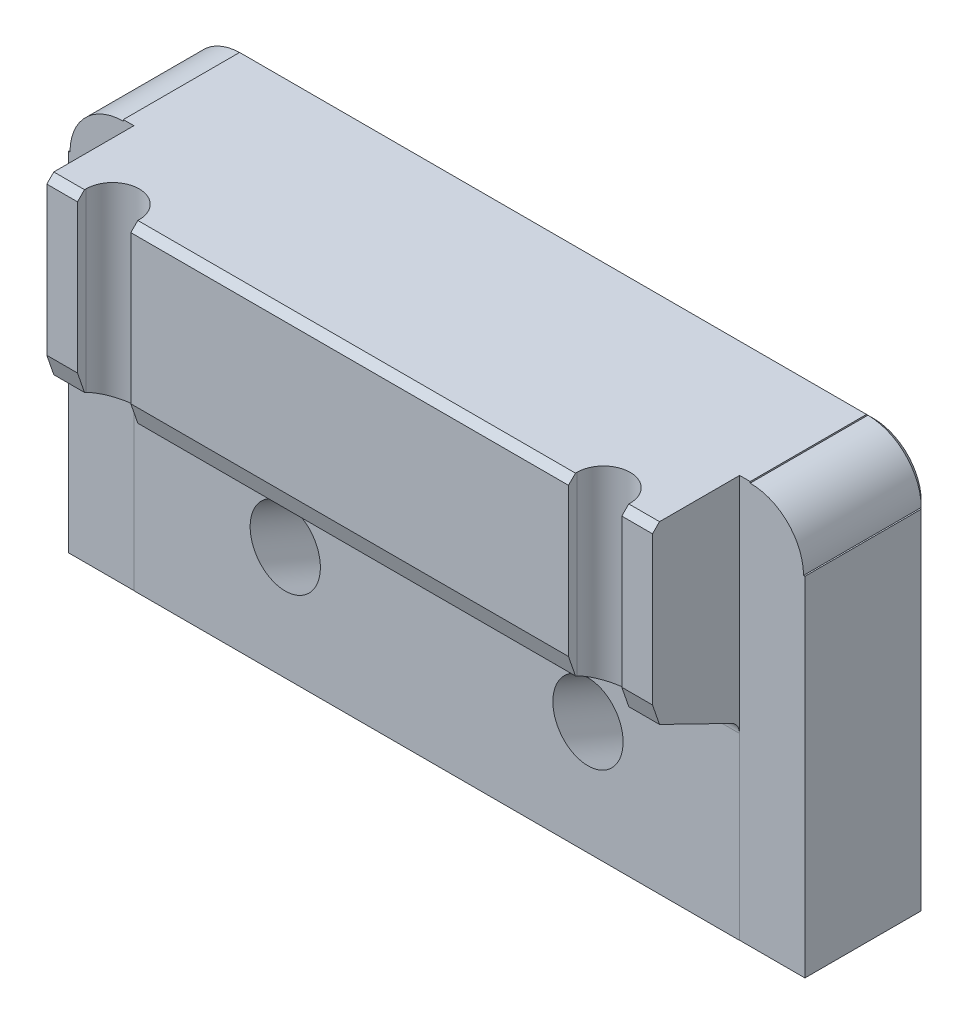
ISO-10303-21;
HEADER;
FILE_DESCRIPTION(('STEP AP214'),'2;1');
FILE_NAME('part.step','',(''),(''),'','','');
FILE_SCHEMA(('AUTOMOTIVE_DESIGN { 1 0 10303 214 1 1 1 1 }'));
ENDSEC;
DATA;
#1=APPLICATION_CONTEXT('core data for automotive mechanical design processes');
#2=APPLICATION_PROTOCOL_DEFINITION('international standard','automotive_design',2000,#1);
#3=PRODUCT_CONTEXT('',#1,'mechanical');
#4=PRODUCT('Part','Part','',(#3));
#5=PRODUCT_RELATED_PRODUCT_CATEGORY('part','',(#4));
#6=PRODUCT_DEFINITION_FORMATION('','',#4);
#7=PRODUCT_DEFINITION_CONTEXT('part definition',#1,'design');
#8=PRODUCT_DEFINITION('design','',#6,#7);
#9=PRODUCT_DEFINITION_SHAPE('','',#8);
#10=(LENGTH_UNIT() NAMED_UNIT(*) SI_UNIT(.MILLI.,.METRE.));
#11=(NAMED_UNIT(*) PLANE_ANGLE_UNIT() SI_UNIT($,.RADIAN.));
#12=(NAMED_UNIT(*) SI_UNIT($,.STERADIAN.) SOLID_ANGLE_UNIT());
#13=UNCERTAINTY_MEASURE_WITH_UNIT(LENGTH_MEASURE(1.E-05),#10,'distance_accuracy_value','');
#14=(GEOMETRIC_REPRESENTATION_CONTEXT(3) GLOBAL_UNCERTAINTY_ASSIGNED_CONTEXT((#13)) GLOBAL_UNIT_ASSIGNED_CONTEXT((#10,
#11,#12)) REPRESENTATION_CONTEXT('',''));
#15=CARTESIAN_POINT('',(0.,0.,0.));
#16=DIRECTION('',(0.,0.,1.));
#17=DIRECTION('',(1.,0.,0.));
#18=AXIS2_PLACEMENT_3D('',#15,#16,#17);
#19=CARTESIAN_POINT('',(66.6623,8.3375937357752,38.1));
#20=DIRECTION('',(0.,0.,-1.));
#21=DIRECTION('',(0.,1.,0.));
#22=AXIS2_PLACEMENT_3D('',#19,#20,#21);
#23=PLANE('',#22);
#24=DIRECTION('',(0.,-1.,0.));
#25=VECTOR('',#24,1.);
#26=CARTESIAN_POINT('',(-49.276,8.3375937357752,38.1));
#27=LINE('',#26,#25);
#28=CARTESIAN_POINT('',(-49.276,35.179,38.1));
#29=VERTEX_POINT('',#28);
#30=CARTESIAN_POINT('',(-49.276,8.3375937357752,38.1));
#31=VERTEX_POINT('',#30);
#32=EDGE_CURVE('E373',#29,#31,#27,.T.);
#33=ORIENTED_EDGE('',*,*,#32,.F.);
#34=DIRECTION('',(-1.,0.,0.));
#35=VECTOR('',#34,1.);
#36=CARTESIAN_POINT('',(66.6623,35.179,38.1));
#37=LINE('',#36,#35);
#38=CARTESIAN_POINT('',(-54.8386,35.179,38.1));
#39=VERTEX_POINT('',#38);
#40=EDGE_CURVE('E559',#29,#39,#37,.T.);
#41=ORIENTED_EDGE('',*,*,#40,.T.);
#42=DIRECTION('',(0.,-1.,0.));
#43=VECTOR('',#42,1.);
#44=CARTESIAN_POINT('',(-54.8386,38.3995230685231,38.1));
#45=LINE('',#44,#43);
#46=CARTESIAN_POINT('',(-54.8386,8.33759373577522,38.1));
#47=VERTEX_POINT('',#46);
#48=EDGE_CURVE('E418',#39,#47,#45,.T.);
#49=ORIENTED_EDGE('',*,*,#48,.T.);
#50=DIRECTION('',(-1.,0.,0.));
#51=VECTOR('',#50,1.);
#52=CARTESIAN_POINT('',(66.6623,8.3375937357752,38.1));
#53=LINE('',#52,#51);
#54=EDGE_CURVE('E472',#31,#47,#53,.T.);
#55=ORIENTED_EDGE('',*,*,#54,.F.);
#56=EDGE_LOOP('',(#33,#41,#49,#55));
#57=FACE_BOUND('',#56,.T.);
#58=ADVANCED_FACE('F15',(#57),#23,.F.);
#59=DIRECTION('',(0.,1.,0.));
#60=VECTOR('',#59,1.);
#61=CARTESIAN_POINT('',(39.624,8.3375937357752,38.1));
#62=LINE('',#61,#60);
#63=CARTESIAN_POINT('',(39.624,8.3375937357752,38.1));
#64=VERTEX_POINT('',#63);
#65=CARTESIAN_POINT('',(39.624,35.179,38.1));
#66=VERTEX_POINT('',#65);
#67=EDGE_CURVE('E396',#64,#66,#62,.T.);
#68=ORIENTED_EDGE('',*,*,#67,.T.);
#69=DIRECTION('',(-1.,0.,0.));
#70=VECTOR('',#69,1.);
#71=CARTESIAN_POINT('',(66.6623,35.179,38.1));
#72=LINE('',#71,#70);
#73=CARTESIAN_POINT('',(-39.624,35.179,38.1));
#74=VERTEX_POINT('',#73);
#75=EDGE_CURVE('E552',#66,#74,#72,.T.);
#76=ORIENTED_EDGE('',*,*,#75,.T.);
#77=DIRECTION('',(0.,1.,0.));
#78=VECTOR('',#77,1.);
#79=CARTESIAN_POINT('',(-39.624,8.3375937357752,38.1));
#80=LINE('',#79,#78);
#81=CARTESIAN_POINT('',(-39.624,8.3375937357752,38.1));
#82=VERTEX_POINT('',#81);
#83=EDGE_CURVE('E368',#82,#74,#80,.T.);
#84=ORIENTED_EDGE('',*,*,#83,.F.);
#85=EDGE_CURVE('E478',#64,#82,#53,.T.);
#86=ORIENTED_EDGE('',*,*,#85,.F.);
#87=EDGE_LOOP('',(#68,#76,#84,#86));
#88=FACE_BOUND('',#87,.T.);
#89=ADVANCED_FACE('F725',(#88),#23,.F.);
#90=CARTESIAN_POINT('',(66.6623,4.64924592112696,36.83));
#91=DIRECTION('',(0.,0.325568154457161,-0.945518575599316));
#92=DIRECTION('',(0.,0.945518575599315,0.325568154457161));
#93=AXIS2_PLACEMENT_3D('',#90,#91,#92);
#94=PLANE('',#93);
#95=DIRECTION('',(0.,-0.945518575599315,-0.325568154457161));
#96=VECTOR('',#95,1.);
#97=CARTESIAN_POINT('',(-49.276,4.64924592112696,36.83));
#98=LINE('',#97,#96);
#99=CARTESIAN_POINT('',(-49.276,4.64924592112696,36.83));
#100=VERTEX_POINT('',#99);
#101=EDGE_CURVE('E371',#31,#100,#98,.T.);
#102=ORIENTED_EDGE('',*,*,#101,.F.);
#103=ORIENTED_EDGE('',*,*,#54,.T.);
#104=DIRECTION('',(0.,0.945518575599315,0.325568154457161));
#105=VECTOR('',#104,1.);
#106=CARTESIAN_POINT('',(-54.8386,4.64924592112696,36.83));
#107=LINE('',#106,#105);
#108=CARTESIAN_POINT('',(-54.8386,4.64924592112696,36.83));
#109=VERTEX_POINT('',#108);
#110=EDGE_CURVE('E454',#109,#47,#107,.T.);
#111=ORIENTED_EDGE('',*,*,#110,.F.);
#112=DIRECTION('',(-1.,0.,0.));
#113=VECTOR('',#112,1.);
#114=CARTESIAN_POINT('',(66.6623,4.64924592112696,36.83));
#115=LINE('',#114,#113);
#116=EDGE_CURVE('E468',#100,#109,#115,.T.);
#117=ORIENTED_EDGE('',*,*,#116,.F.);
#118=EDGE_LOOP('',(#102,#103,#111,#117));
#119=FACE_BOUND('',#118,.T.);
#120=ADVANCED_FACE('F731',(#119),#94,.F.);
#121=DIRECTION('',(0.,0.945518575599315,0.325568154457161));
#122=VECTOR('',#121,1.);
#123=CARTESIAN_POINT('',(-39.624,4.64924592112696,36.83));
#124=LINE('',#123,#122);
#125=CARTESIAN_POINT('',(-39.624,4.64924592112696,36.83));
#126=VERTEX_POINT('',#125);
#127=EDGE_CURVE('E365',#126,#82,#124,.T.);
#128=ORIENTED_EDGE('',*,*,#127,.F.);
#129=CARTESIAN_POINT('',(39.624,4.64924592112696,36.83));
#130=VERTEX_POINT('',#129);
#131=EDGE_CURVE('E473',#130,#126,#115,.T.);
#132=ORIENTED_EDGE('',*,*,#131,.F.);
#133=DIRECTION('',(0.,0.945518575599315,0.325568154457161));
#134=VECTOR('',#133,1.);
#135=CARTESIAN_POINT('',(39.624,4.64924592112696,36.83));
#136=LINE('',#135,#134);
#137=EDGE_CURVE('E393',#130,#64,#136,.T.);
#138=ORIENTED_EDGE('',*,*,#137,.T.);
#139=ORIENTED_EDGE('',*,*,#85,.T.);
#140=EDGE_LOOP('',(#128,#132,#138,#139));
#141=FACE_BOUND('',#140,.T.);
#142=ADVANCED_FACE('F741',(#141),#94,.F.);
#143=CARTESIAN_POINT('',(66.6623,36.449,38.1));
#144=DIRECTION('',(0.,-1.,0.));
#145=DIRECTION('',(0.,0.,-1.));
#146=AXIS2_PLACEMENT_3D('',#143,#144,#145);
#147=PLANE('',#146);
#148=DIRECTION('',(0.,0.,-1.));
#149=VECTOR('',#148,1.);
#150=CARTESIAN_POINT('',(49.276,36.449,36.576));
#151=LINE('',#150,#149);
#152=CARTESIAN_POINT('',(49.276,36.449,36.83));
#153=VERTEX_POINT('',#152);
#154=CARTESIAN_POINT('',(49.276,36.449,36.576));
#155=VERTEX_POINT('',#154);
#156=EDGE_CURVE('E375',#153,#155,#151,.T.);
#157=ORIENTED_EDGE('',*,*,#156,.F.);
#158=DIRECTION('',(1.,0.,0.));
#159=VECTOR('',#158,1.);
#160=CARTESIAN_POINT('',(66.6623,36.449,36.83));
#161=LINE('',#160,#159);
#162=CARTESIAN_POINT('',(54.8386,36.449,36.83));
#163=VERTEX_POINT('',#162);
#164=EDGE_CURVE('E548',#153,#163,#161,.T.);
#165=ORIENTED_EDGE('',*,*,#164,.T.);
#166=DIRECTION('',(0.,0.,1.));
#167=VECTOR('',#166,1.);
#168=CARTESIAN_POINT('',(54.8386,36.449,38.1));
#169=LINE('',#168,#167);
#170=CARTESIAN_POINT('',(54.8386,36.449,22.3266));
#171=VERTEX_POINT('',#170);
#172=EDGE_CURVE('E446',#171,#163,#169,.T.);
#173=ORIENTED_EDGE('',*,*,#172,.F.);
#174=DIRECTION('',(-1.,0.,0.));
#175=VECTOR('',#174,1.);
#176=CARTESIAN_POINT('',(66.6623,36.449,22.3266));
#177=LINE('',#176,#175);
#178=CARTESIAN_POINT('',(56.7563,36.449,22.3266));
#179=VERTEX_POINT('',#178);
#180=EDGE_CURVE('E436',#179,#171,#177,.T.);
#181=ORIENTED_EDGE('',*,*,#180,.F.);
#182=DIRECTION('',(0.,0.,-1.));
#183=VECTOR('',#182,1.);
#184=CARTESIAN_POINT('',(56.7563,36.449,38.1));
#185=LINE('',#184,#183);
#186=CARTESIAN_POINT('',(56.7563,36.449,1.26999999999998));
#187=VERTEX_POINT('',#186);
#188=EDGE_CURVE('E412',#179,#187,#185,.T.);
#189=ORIENTED_EDGE('',*,*,#188,.T.);
#190=DIRECTION('',(-1.,0.,0.));
#191=VECTOR('',#190,1.);
#192=CARTESIAN_POINT('',(66.6623,36.449,1.26999999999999));
#193=LINE('',#192,#191);
#194=CARTESIAN_POINT('',(-56.7563,36.449,1.26999999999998));
#195=VERTEX_POINT('',#194);
#196=EDGE_CURVE('E541',#187,#195,#193,.T.);
#197=ORIENTED_EDGE('',*,*,#196,.T.);
#198=DIRECTION('',(0.,0.,-1.));
#199=VECTOR('',#198,1.);
#200=CARTESIAN_POINT('',(-56.7563,36.449,38.1));
#201=LINE('',#200,#199);
#202=CARTESIAN_POINT('',(-56.7563,36.449,22.3266));
#203=VERTEX_POINT('',#202);
#204=EDGE_CURVE('E406',#203,#195,#201,.T.);
#205=ORIENTED_EDGE('',*,*,#204,.F.);
#206=CARTESIAN_POINT('',(-54.8386,36.449,22.3266));
#207=VERTEX_POINT('',#206);
#208=EDGE_CURVE('E431',#207,#203,#177,.T.);
#209=ORIENTED_EDGE('',*,*,#208,.F.);
#210=DIRECTION('',(0.,0.,-1.));
#211=VECTOR('',#210,1.);
#212=CARTESIAN_POINT('',(-54.8386,36.449,38.1));
#213=LINE('',#212,#211);
#214=CARTESIAN_POINT('',(-54.8386,36.449,36.83));
#215=VERTEX_POINT('',#214);
#216=EDGE_CURVE('E457',#215,#207,#213,.T.);
#217=ORIENTED_EDGE('',*,*,#216,.F.);
#218=DIRECTION('',(1.,0.,0.));
#219=VECTOR('',#218,1.);
#220=CARTESIAN_POINT('',(66.6623,36.449,36.83));
#221=LINE('',#220,#219);
#222=CARTESIAN_POINT('',(-49.276,36.449,36.83));
#223=VERTEX_POINT('',#222);
#224=EDGE_CURVE('E544',#215,#223,#221,.T.);
#225=ORIENTED_EDGE('',*,*,#224,.T.);
#226=DIRECTION('',(0.,0.,-1.));
#227=VECTOR('',#226,1.);
#228=CARTESIAN_POINT('',(-49.276,36.449,36.576));
#229=LINE('',#228,#227);
#230=CARTESIAN_POINT('',(-49.276,36.449,36.576));
#231=VERTEX_POINT('',#230);
#232=EDGE_CURVE('E359',#223,#231,#229,.T.);
#233=ORIENTED_EDGE('',*,*,#232,.T.);
#234=CARTESIAN_POINT('',(-44.45,36.449,36.576));
#235=DIRECTION('',(0.,-1.,0.));
#236=DIRECTION('',(0.,0.,-1.));
#237=AXIS2_PLACEMENT_3D('',#234,#235,#236);
#238=CIRCLE('',#237,4.826);
#239=CARTESIAN_POINT('',(-39.624,36.449,36.576));
#240=VERTEX_POINT('',#239);
#241=EDGE_CURVE('E355',#231,#240,#238,.T.);
#242=ORIENTED_EDGE('',*,*,#241,.T.);
#243=DIRECTION('',(0.,0.,1.));
#244=VECTOR('',#243,1.);
#245=CARTESIAN_POINT('',(-39.624,36.449,56.3881036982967));
#246=LINE('',#245,#244);
#247=CARTESIAN_POINT('',(-39.624,36.449,36.83));
#248=VERTEX_POINT('',#247);
#249=EDGE_CURVE('E352',#240,#248,#246,.T.);
#250=ORIENTED_EDGE('',*,*,#249,.T.);
#251=DIRECTION('',(1.,0.,0.));
#252=VECTOR('',#251,1.);
#253=CARTESIAN_POINT('',(66.6623,36.449,36.83));
#254=LINE('',#253,#252);
#255=CARTESIAN_POINT('',(39.624,36.449,36.83));
#256=VERTEX_POINT('',#255);
#257=EDGE_CURVE('E546',#248,#256,#254,.T.);
#258=ORIENTED_EDGE('',*,*,#257,.T.);
#259=DIRECTION('',(0.,0.,1.));
#260=VECTOR('',#259,1.);
#261=CARTESIAN_POINT('',(39.624,36.449,56.3881036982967));
#262=LINE('',#261,#260);
#263=CARTESIAN_POINT('',(39.624,36.449,36.576));
#264=VERTEX_POINT('',#263);
#265=EDGE_CURVE('E380',#264,#256,#262,.T.);
#266=ORIENTED_EDGE('',*,*,#265,.F.);
#267=CARTESIAN_POINT('',(44.45,36.449,36.576));
#268=DIRECTION('',(0.,1.,0.));
#269=DIRECTION('',(0.,0.,-1.));
#270=AXIS2_PLACEMENT_3D('',#267,#268,#269);
#271=CIRCLE('',#270,4.826);
#272=EDGE_CURVE('E377',#155,#264,#271,.T.);
#273=ORIENTED_EDGE('',*,*,#272,.F.);
#274=EDGE_LOOP('',(#157,#165,#173,#181,#189,#197,#205,#209,#217,#225,#233,#242,#250,#258,#266,#273));
#275=FACE_BOUND('',#274,.T.);
#276=ADVANCED_FACE('F659',(#275),#147,.F.);
#277=CARTESIAN_POINT('',(66.6623,-2.41214649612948,22.352));
#278=DIRECTION('',(0.,0.89879404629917,-0.438371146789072));
#279=DIRECTION('',(0.,0.438371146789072,0.89879404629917));
#280=AXIS2_PLACEMENT_3D('',#277,#278,#279);
#281=PLANE('',#280);
#282=DIRECTION('',(0.,0.438371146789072,0.89879404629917));
#283=VECTOR('',#282,1.);
#284=CARTESIAN_POINT('',(-54.8386,-2.41214649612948,22.352));
#285=LINE('',#284,#283);
#286=CARTESIAN_POINT('',(-54.8386,-1.71637777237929,23.7785372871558));
#287=VERTEX_POINT('',#286);
#288=EDGE_CURVE('E452',#287,#109,#285,.T.);
#289=ORIENTED_EDGE('',*,*,#288,.F.);
#290=DIRECTION('',(-1.,0.,0.));
#291=VECTOR('',#290,1.);
#292=CARTESIAN_POINT('',(54.8386,-1.71637777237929,23.7785372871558));
#293=LINE('',#292,#291);
#294=CARTESIAN_POINT('',(54.8386,-1.71637777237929,23.7785372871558));
#295=VERTEX_POINT('',#294);
#296=EDGE_CURVE('E522',#287,#295,#293,.F.);
#297=ORIENTED_EDGE('',*,*,#296,.T.);
#298=DIRECTION('',(0.,-0.438371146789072,-0.89879404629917));
#299=VECTOR('',#298,1.);
#300=CARTESIAN_POINT('',(54.8386,-2.41214649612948,22.352));
#301=LINE('',#300,#299);
#302=CARTESIAN_POINT('',(54.8386,4.64924592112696,36.83));
#303=VERTEX_POINT('',#302);
#304=EDGE_CURVE('E441',#303,#295,#301,.T.);
#305=ORIENTED_EDGE('',*,*,#304,.F.);
#306=CARTESIAN_POINT('',(49.276,4.64924592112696,36.83));
#307=VERTEX_POINT('',#306);
#308=EDGE_CURVE('E469',#303,#307,#115,.T.);
#309=ORIENTED_EDGE('',*,*,#308,.T.);
#310=DIRECTION('',(0.,-0.438371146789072,-0.89879404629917));
#311=VECTOR('',#310,1.);
#312=CARTESIAN_POINT('',(49.276,-2.41214649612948,22.352));
#313=LINE('',#312,#311);
#314=CARTESIAN_POINT('',(49.276,4.52536184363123,36.576));
#315=VERTEX_POINT('',#314);
#316=EDGE_CURVE('E503',#307,#315,#313,.T.);
#317=ORIENTED_EDGE('',*,*,#316,.T.);
#318=CARTESIAN_POINT('',(44.45,4.52536184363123,36.576));
#319=DIRECTION('',(0.,0.89879404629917,-0.438371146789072));
#320=DIRECTION('',(0.,0.438371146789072,0.89879404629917));
#321=AXIS2_PLACEMENT_3D('',#318,#319,#320);
#322=ELLIPSE('',#321,5.36941696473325,4.826);
#323=CARTESIAN_POINT('',(39.624,4.52536184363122,36.576));
#324=VERTEX_POINT('',#323);
#325=EDGE_CURVE('E506',#315,#324,#322,.T.);
#326=ORIENTED_EDGE('',*,*,#325,.T.);
#327=DIRECTION('',(0.,0.438371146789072,0.89879404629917));
#328=VECTOR('',#327,1.);
#329=CARTESIAN_POINT('',(39.624,-2.41214649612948,22.352));
#330=LINE('',#329,#328);
#331=EDGE_CURVE('E509',#324,#130,#330,.T.);
#332=ORIENTED_EDGE('',*,*,#331,.T.);
#333=ORIENTED_EDGE('',*,*,#131,.T.);
#334=DIRECTION('',(0.,0.438371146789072,0.89879404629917));
#335=VECTOR('',#334,1.);
#336=CARTESIAN_POINT('',(-39.624,-2.41214649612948,22.352));
#337=LINE('',#336,#335);
#338=CARTESIAN_POINT('',(-39.624,4.52536184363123,36.576));
#339=VERTEX_POINT('',#338);
#340=EDGE_CURVE('E512',#339,#126,#337,.T.);
#341=ORIENTED_EDGE('',*,*,#340,.F.);
#342=CARTESIAN_POINT('',(-44.45,4.52536184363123,36.576));
#343=DIRECTION('',(0.,0.89879404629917,-0.438371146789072));
#344=DIRECTION('',(0.,0.438371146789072,0.89879404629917));
#345=AXIS2_PLACEMENT_3D('',#342,#343,#344);
#346=ELLIPSE('',#345,5.36941696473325,4.826);
#347=CARTESIAN_POINT('',(-49.276,4.52536184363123,36.576));
#348=VERTEX_POINT('',#347);
#349=EDGE_CURVE('E514',#348,#339,#346,.F.);
#350=ORIENTED_EDGE('',*,*,#349,.F.);
#351=DIRECTION('',(0.,-0.438371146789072,-0.89879404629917));
#352=VECTOR('',#351,1.);
#353=CARTESIAN_POINT('',(-49.276,-2.41214649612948,22.352));
#354=LINE('',#353,#352);
#355=EDGE_CURVE('E517',#100,#348,#354,.T.);
#356=ORIENTED_EDGE('',*,*,#355,.F.);
#357=ORIENTED_EDGE('',*,*,#116,.T.);
#358=EDGE_LOOP('',(#289,#297,#305,#309,#317,#326,#332,#333,#341,#350,#356,#357));
#359=FACE_BOUND('',#358,.T.);
#360=ADVANCED_FACE('F677',(#359),#281,.F.);
#361=CARTESIAN_POINT('',(-66.6623,36.449,0.));
#362=DIRECTION('',(-1.,0.,0.));
#363=DIRECTION('',(0.,0.,1.));
#364=AXIS2_PLACEMENT_3D('',#361,#362,#363);
#365=PLANE('',#364);
#366=DIRECTION('',(0.,0.,-1.));
#367=VECTOR('',#366,1.);
#368=CARTESIAN_POINT('',(-66.6623,26.543,0.));
#369=LINE('',#368,#367);
#370=CARTESIAN_POINT('',(-66.6623,26.543,22.3266));
#371=VERTEX_POINT('',#370);
#372=CARTESIAN_POINT('',(-66.6623,26.543,1.26999999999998));
#373=VERTEX_POINT('',#372);
#374=EDGE_CURVE('E402',#371,#373,#369,.T.);
#375=ORIENTED_EDGE('',*,*,#374,.T.);
#376=DIRECTION('',(0.,-1.,0.));
#377=VECTOR('',#376,1.);
#378=CARTESIAN_POINT('',(-66.6623,-36.449,1.26999999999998));
#379=LINE('',#378,#377);
#380=CARTESIAN_POINT('',(-66.6623,-36.449,1.26999999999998));
#381=VERTEX_POINT('',#380);
#382=EDGE_CURVE('E582',#373,#381,#379,.T.);
#383=ORIENTED_EDGE('',*,*,#382,.T.);
#384=DIRECTION('',(0.,0.,-1.));
#385=VECTOR('',#384,1.);
#386=CARTESIAN_POINT('',(-66.6623,-36.449,0.));
#387=LINE('',#386,#385);
#388=CARTESIAN_POINT('',(-66.6623,-36.449,22.3266));
#389=VERTEX_POINT('',#388);
#390=EDGE_CURVE('E459',#389,#381,#387,.T.);
#391=ORIENTED_EDGE('',*,*,#390,.F.);
#392=DIRECTION('',(0.,1.,0.));
#393=VECTOR('',#392,1.);
#394=CARTESIAN_POINT('',(-66.6623,36.449,22.3266));
#395=LINE('',#394,#393);
#396=EDGE_CURVE('E477',#389,#371,#395,.T.);
#397=ORIENTED_EDGE('',*,*,#396,.T.);
#398=EDGE_LOOP('',(#375,#383,#391,#397));
#399=FACE_BOUND('',#398,.T.);
#400=ADVANCED_FACE('F620',(#399),#365,.T.);
#401=CARTESIAN_POINT('',(66.6623,36.449,0.));
#402=DIRECTION('',(0.,0.,1.));
#403=DIRECTION('',(1.,0.,0.));
#404=AXIS2_PLACEMENT_3D('',#401,#402,#403);
#405=PLANE('',#404);
#406=CARTESIAN_POINT('',(49.6316,-26.162,0.));
#407=DIRECTION('',(0.,0.,-1.));
#408=DIRECTION('',(-1.,0.,0.));
#409=AXIS2_PLACEMENT_3D('',#406,#407,#408);
#410=CIRCLE('',#409,3.96875);
#411=CARTESIAN_POINT('',(45.66285,-26.162,0.));
#412=VERTEX_POINT('',#411);
#413=EDGE_CURVE('E274',#412,#412,#410,.T.);
#414=ORIENTED_EDGE('',*,*,#413,.F.);
#415=EDGE_LOOP('',(#414));
#416=FACE_BOUND('',#415,.T.);
#417=CARTESIAN_POINT('',(49.6316,26.162,0.));
#418=DIRECTION('',(0.,0.,-1.));
#419=DIRECTION('',(-1.,0.,0.));
#420=AXIS2_PLACEMENT_3D('',#417,#418,#419);
#421=CIRCLE('',#420,3.96875);
#422=CARTESIAN_POINT('',(45.66285,26.162,0.));
#423=VERTEX_POINT('',#422);
#424=EDGE_CURVE('E286',#423,#423,#421,.T.);
#425=ORIENTED_EDGE('',*,*,#424,.F.);
#426=EDGE_LOOP('',(#425));
#427=FACE_BOUND('',#426,.T.);
#428=CARTESIAN_POINT('',(0.,26.162,0.));
#429=DIRECTION('',(0.,0.,-1.));
#430=DIRECTION('',(-1.,0.,0.));
#431=AXIS2_PLACEMENT_3D('',#428,#429,#430);
#432=CIRCLE('',#431,3.96875);
#433=CARTESIAN_POINT('',(-3.96875,26.162,0.));
#434=VERTEX_POINT('',#433);
#435=EDGE_CURVE('E298',#434,#434,#432,.T.);
#436=ORIENTED_EDGE('',*,*,#435,.F.);
#437=EDGE_LOOP('',(#436));
#438=FACE_BOUND('',#437,.T.);
#439=CARTESIAN_POINT('',(0.,-26.162,0.));
#440=DIRECTION('',(0.,0.,-1.));
#441=DIRECTION('',(-1.,0.,0.));
#442=AXIS2_PLACEMENT_3D('',#439,#440,#441);
#443=CIRCLE('',#442,3.96875);
#444=CARTESIAN_POINT('',(-3.96875,-26.162,0.));
#445=VERTEX_POINT('',#444);
#446=EDGE_CURVE('E310',#445,#445,#443,.T.);
#447=ORIENTED_EDGE('',*,*,#446,.F.);
#448=EDGE_LOOP('',(#447));
#449=FACE_BOUND('',#448,.T.);
#450=CARTESIAN_POINT('',(-49.6316,-26.162,0.));
#451=DIRECTION('',(0.,0.,-1.));
#452=DIRECTION('',(-1.,0.,0.));
#453=AXIS2_PLACEMENT_3D('',#450,#451,#452);
#454=CIRCLE('',#453,3.96875);
#455=CARTESIAN_POINT('',(-53.60035,-26.162,0.));
#456=VERTEX_POINT('',#455);
#457=EDGE_CURVE('E322',#456,#456,#454,.T.);
#458=ORIENTED_EDGE('',*,*,#457,.F.);
#459=EDGE_LOOP('',(#458));
#460=FACE_BOUND('',#459,.T.);
#461=CARTESIAN_POINT('',(-49.6316,26.162,0.));
#462=DIRECTION('',(0.,0.,-1.));
#463=DIRECTION('',(-1.,0.,0.));
#464=AXIS2_PLACEMENT_3D('',#461,#462,#463);
#465=CIRCLE('',#464,3.96875);
#466=CARTESIAN_POINT('',(-53.60035,26.162,0.));
#467=VERTEX_POINT('',#466);
#468=EDGE_CURVE('E334',#467,#467,#465,.T.);
#469=ORIENTED_EDGE('',*,*,#468,.F.);
#470=EDGE_LOOP('',(#469));
#471=FACE_BOUND('',#470,.T.);
#472=CARTESIAN_POINT('',(-27.4066,-25.3746,0.));
#473=DIRECTION('',(0.,0.,1.));
#474=DIRECTION('',(0.,-1.,0.));
#475=AXIS2_PLACEMENT_3D('',#472,#473,#474);
#476=ELLIPSE('',#475,9.51977598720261,8.763);
#477=CARTESIAN_POINT('',(-27.4066,-34.8943759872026,0.));
#478=VERTEX_POINT('',#477);
#479=EDGE_CURVE('E348',#478,#478,#476,.T.);
#480=ORIENTED_EDGE('',*,*,#479,.T.);
#481=EDGE_LOOP('',(#480));
#482=FACE_BOUND('',#481,.T.);
#483=CARTESIAN_POINT('',(27.4066,-25.3746,0.));
#484=DIRECTION('',(0.,0.,1.));
#485=DIRECTION('',(0.,-1.,0.));
#486=AXIS2_PLACEMENT_3D('',#483,#484,#485);
#487=ELLIPSE('',#486,9.51977598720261,8.763);
#488=CARTESIAN_POINT('',(27.4066,-34.8943759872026,0.));
#489=VERTEX_POINT('',#488);
#490=EDGE_CURVE('E356',#489,#489,#487,.T.);
#491=ORIENTED_EDGE('',*,*,#490,.T.);
#492=EDGE_LOOP('',(#491));
#493=FACE_BOUND('',#492,.T.);
#494=DIRECTION('',(1.,0.,0.));
#495=VECTOR('',#494,1.);
#496=CARTESIAN_POINT('',(66.6623,35.179,0.));
#497=LINE('',#496,#495);
#498=CARTESIAN_POINT('',(-56.7563,35.179,0.));
#499=VERTEX_POINT('',#498);
#500=CARTESIAN_POINT('',(56.7563,35.179,0.));
#501=VERTEX_POINT('',#500);
#502=EDGE_CURVE('E575',#499,#501,#497,.T.);
#503=ORIENTED_EDGE('',*,*,#502,.T.);
#504=CARTESIAN_POINT('',(56.7563,26.543,0.));
#505=DIRECTION('',(0.,0.,1.));
#506=DIRECTION('',(1.,0.,0.));
#507=AXIS2_PLACEMENT_3D('',#504,#505,#506);
#508=CIRCLE('',#507,8.636);
#509=CARTESIAN_POINT('',(65.3923,26.543,0.));
#510=VERTEX_POINT('',#509);
#511=EDGE_CURVE('E595',#501,#510,#508,.F.);
#512=ORIENTED_EDGE('',*,*,#511,.T.);
#513=DIRECTION('',(0.,-1.,0.));
#514=VECTOR('',#513,1.);
#515=CARTESIAN_POINT('',(65.3923,36.449,0.));
#516=LINE('',#515,#514);
#517=CARTESIAN_POINT('',(65.3923,-35.179,0.));
#518=VERTEX_POINT('',#517);
#519=EDGE_CURVE('E569',#510,#518,#516,.T.);
#520=ORIENTED_EDGE('',*,*,#519,.T.);
#521=DIRECTION('',(-1.,0.,0.));
#522=VECTOR('',#521,1.);
#523=CARTESIAN_POINT('',(66.6623,-35.179,0.));
#524=LINE('',#523,#522);
#525=CARTESIAN_POINT('',(-65.3923,-35.179,0.));
#526=VERTEX_POINT('',#525);
#527=EDGE_CURVE('E571',#518,#526,#524,.T.);
#528=ORIENTED_EDGE('',*,*,#527,.T.);
#529=DIRECTION('',(0.,1.,0.));
#530=VECTOR('',#529,1.);
#531=CARTESIAN_POINT('',(-65.3923,26.543,0.));
#532=LINE('',#531,#530);
#533=CARTESIAN_POINT('',(-65.3923,26.543,0.));
#534=VERTEX_POINT('',#533);
#535=EDGE_CURVE('E573',#526,#534,#532,.T.);
#536=ORIENTED_EDGE('',*,*,#535,.T.);
#537=CARTESIAN_POINT('',(-56.7563,26.543,0.));
#538=DIRECTION('',(0.,0.,1.));
#539=DIRECTION('',(1.,0.,0.));
#540=AXIS2_PLACEMENT_3D('',#537,#538,#539);
#541=CIRCLE('',#540,8.636);
#542=EDGE_CURVE('E591',#534,#499,#541,.F.);
#543=ORIENTED_EDGE('',*,*,#542,.T.);
#544=EDGE_LOOP('',(#503,#512,#520,#528,#536,#543));
#545=FACE_BOUND('',#544,.T.);
#546=ADVANCED_FACE('F706',(#416,#427,#438,#449,#460,#471,#482,#493,#545),#405,.F.);
#547=CARTESIAN_POINT('',(0.,-9.82235179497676,22.3266));
#548=DIRECTION('',(0.,0.,1.));
#549=DIRECTION('',(1.,0.,0.));
#550=AXIS2_PLACEMENT_3D('',#547,#548,#549);
#551=PLANE('',#550);
#552=ORIENTED_EDGE('',*,*,#208,.T.);
#553=DIRECTION('',(0.,-1.,0.));
#554=VECTOR('',#553,1.);
#555=CARTESIAN_POINT('',(-56.7563,-9.82235179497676,22.3266));
#556=LINE('',#555,#554);
#557=CARTESIAN_POINT('',(-56.7563,36.195,22.3266));
#558=VERTEX_POINT('',#557);
#559=EDGE_CURVE('E500',#203,#558,#556,.T.);
#560=ORIENTED_EDGE('',*,*,#559,.T.);
#561=CARTESIAN_POINT('',(-56.7563,26.543,22.3266));
#562=DIRECTION('',(0.,0.,1.));
#563=DIRECTION('',(1.,0.,0.));
#564=AXIS2_PLACEMENT_3D('',#561,#562,#563);
#565=CIRCLE('',#564,9.652);
#566=CARTESIAN_POINT('',(-66.4083,26.543,22.3266));
#567=VERTEX_POINT('',#566);
#568=EDGE_CURVE('E497',#558,#567,#565,.T.);
#569=ORIENTED_EDGE('',*,*,#568,.T.);
#570=DIRECTION('',(-1.,0.,0.));
#571=VECTOR('',#570,1.);
#572=CARTESIAN_POINT('',(0.,26.543,22.3266));
#573=LINE('',#572,#571);
#574=EDGE_CURVE('E494',#567,#371,#573,.T.);
#575=ORIENTED_EDGE('',*,*,#574,.T.);
#576=ORIENTED_EDGE('',*,*,#396,.F.);
#577=DIRECTION('',(1.,0.,0.));
#578=VECTOR('',#577,1.);
#579=CARTESIAN_POINT('',(66.6623,-36.449,22.3266));
#580=LINE('',#579,#578);
#581=CARTESIAN_POINT('',(-54.8386,-36.449,22.3266));
#582=VERTEX_POINT('',#581);
#583=EDGE_CURVE('E429',#389,#582,#580,.T.);
#584=ORIENTED_EDGE('',*,*,#583,.T.);
#585=DIRECTION('',(0.,-1.,0.));
#586=VECTOR('',#585,1.);
#587=CARTESIAN_POINT('',(-54.8386,38.3995230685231,22.3266));
#588=LINE('',#587,#586);
#589=EDGE_CURVE('E423',#207,#582,#588,.T.);
#590=ORIENTED_EDGE('',*,*,#589,.F.);
#591=EDGE_LOOP('',(#552,#560,#569,#575,#576,#584,#590));
#592=FACE_BOUND('',#591,.T.);
#593=ADVANCED_FACE('F694',(#592),#551,.T.);
#594=DIRECTION('',(0.,1.,0.));
#595=VECTOR('',#594,1.);
#596=CARTESIAN_POINT('',(54.8386,38.3995230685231,38.1));
#597=LINE('',#596,#595);
#598=CARTESIAN_POINT('',(54.8386,8.33759373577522,38.1));
#599=VERTEX_POINT('',#598);
#600=CARTESIAN_POINT('',(54.8386,35.179,38.1));
#601=VERTEX_POINT('',#600);
#602=EDGE_CURVE('E420',#599,#601,#597,.T.);
#603=ORIENTED_EDGE('',*,*,#602,.T.);
#604=DIRECTION('',(-1.,0.,0.));
#605=VECTOR('',#604,1.);
#606=CARTESIAN_POINT('',(66.6623,35.179,38.1));
#607=LINE('',#606,#605);
#608=CARTESIAN_POINT('',(49.276,35.179,38.1));
#609=VERTEX_POINT('',#608);
#610=EDGE_CURVE('E528',#601,#609,#607,.T.);
#611=ORIENTED_EDGE('',*,*,#610,.T.);
#612=DIRECTION('',(0.,-1.,0.));
#613=VECTOR('',#612,1.);
#614=CARTESIAN_POINT('',(49.276,8.3375937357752,38.1));
#615=LINE('',#614,#613);
#616=CARTESIAN_POINT('',(49.276,8.3375937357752,38.1));
#617=VERTEX_POINT('',#616);
#618=EDGE_CURVE('E391',#609,#617,#615,.T.);
#619=ORIENTED_EDGE('',*,*,#618,.T.);
#620=EDGE_CURVE('E474',#599,#617,#53,.T.);
#621=ORIENTED_EDGE('',*,*,#620,.F.);
#622=EDGE_LOOP('',(#603,#611,#619,#621));
#623=FACE_BOUND('',#622,.T.);
#624=ADVANCED_FACE('F667',(#623),#23,.F.);
#625=ORIENTED_EDGE('',*,*,#620,.T.);
#626=DIRECTION('',(0.,-0.945518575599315,-0.325568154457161));
#627=VECTOR('',#626,1.);
#628=CARTESIAN_POINT('',(49.276,4.64924592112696,36.83));
#629=LINE('',#628,#627);
#630=EDGE_CURVE('E386',#617,#307,#629,.T.);
#631=ORIENTED_EDGE('',*,*,#630,.T.);
#632=ORIENTED_EDGE('',*,*,#308,.F.);
#633=DIRECTION('',(0.,-0.945518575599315,-0.325568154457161));
#634=VECTOR('',#633,1.);
#635=CARTESIAN_POINT('',(54.8386,4.64924592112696,36.83));
#636=LINE('',#635,#634);
#637=EDGE_CURVE('E444',#599,#303,#636,.T.);
#638=ORIENTED_EDGE('',*,*,#637,.F.);
#639=EDGE_LOOP('',(#625,#631,#632,#638));
#640=FACE_BOUND('',#639,.T.);
#641=ADVANCED_FACE('F671',(#640),#94,.F.);
#642=CARTESIAN_POINT('',(66.6623,-36.449,22.352));
#643=DIRECTION('',(0.,0.,-1.));
#644=DIRECTION('',(0.,1.,0.));
#645=AXIS2_PLACEMENT_3D('',#642,#643,#644);
#646=PLANE('',#645);
#647=CARTESIAN_POINT('',(-27.4066,-15.8867389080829,22.352));
#648=DIRECTION('',(0.,0.,-1.));
#649=DIRECTION('',(0.,-1.,0.));
#650=AXIS2_PLACEMENT_3D('',#647,#648,#649);
#651=ELLIPSE('',#650,6.90528678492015,6.35635);
#652=CARTESIAN_POINT('',(-27.4066,-22.792025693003,22.352));
#653=VERTEX_POINT('',#652);
#654=EDGE_CURVE('E343',#653,#653,#651,.T.);
#655=ORIENTED_EDGE('',*,*,#654,.T.);
#656=EDGE_LOOP('',(#655));
#657=FACE_BOUND('',#656,.T.);
#658=CARTESIAN_POINT('',(27.4066,-15.8867389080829,22.352));
#659=DIRECTION('',(0.,0.,-1.));
#660=DIRECTION('',(0.,-1.,0.));
#661=AXIS2_PLACEMENT_3D('',#658,#659,#660);
#662=ELLIPSE('',#661,6.90528678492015,6.35635);
#663=CARTESIAN_POINT('',(27.4066,-22.792025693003,22.352));
#664=VERTEX_POINT('',#663);
#665=EDGE_CURVE('E351',#664,#664,#662,.T.);
#666=ORIENTED_EDGE('',*,*,#665,.T.);
#667=EDGE_LOOP('',(#666));
#668=FACE_BOUND('',#667,.T.);
#669=DIRECTION('',(0.,-1.,0.));
#670=VECTOR('',#669,1.);
#671=CARTESIAN_POINT('',(54.8386,-36.449,22.352));
#672=LINE('',#671,#670);
#673=CARTESIAN_POINT('',(54.8386,-3.99931464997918,22.352));
#674=VERTEX_POINT('',#673);
#675=CARTESIAN_POINT('',(54.8386,-36.449,22.352));
#676=VERTEX_POINT('',#675);
#677=EDGE_CURVE('E439',#674,#676,#672,.T.);
#678=ORIENTED_EDGE('',*,*,#677,.F.);
#679=DIRECTION('',(-1.,0.,0.));
#680=VECTOR('',#679,1.);
#681=CARTESIAN_POINT('',(-54.8386,-3.99931464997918,22.352));
#682=LINE('',#681,#680);
#683=CARTESIAN_POINT('',(-54.8386,-3.99931464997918,22.352));
#684=VERTEX_POINT('',#683);
#685=EDGE_CURVE('E519',#674,#684,#682,.T.);
#686=ORIENTED_EDGE('',*,*,#685,.T.);
#687=DIRECTION('',(0.,1.,0.));
#688=VECTOR('',#687,1.);
#689=CARTESIAN_POINT('',(-54.8386,-36.449,22.352));
#690=LINE('',#689,#688);
#691=CARTESIAN_POINT('',(-54.8386,-36.449,22.352));
#692=VERTEX_POINT('',#691);
#693=EDGE_CURVE('E449',#692,#684,#690,.T.);
#694=ORIENTED_EDGE('',*,*,#693,.F.);
#695=DIRECTION('',(-1.,0.,0.));
#696=VECTOR('',#695,1.);
#697=CARTESIAN_POINT('',(66.6623,-36.449,22.352));
#698=LINE('',#697,#696);
#699=EDGE_CURVE('E463',#676,#692,#698,.T.);
#700=ORIENTED_EDGE('',*,*,#699,.F.);
#701=EDGE_LOOP('',(#678,#686,#694,#700));
#702=FACE_BOUND('',#701,.T.);
#703=ADVANCED_FACE('F685',(#657,#668,#702),#646,.F.);
#704=CARTESIAN_POINT('',(66.6623,-36.449,0.));
#705=DIRECTION('',(0.,1.,0.));
#706=DIRECTION('',(0.,0.,1.));
#707=AXIS2_PLACEMENT_3D('',#704,#705,#706);
#708=PLANE('',#707);
#709=ORIENTED_EDGE('',*,*,#390,.T.);
#710=DIRECTION('',(1.,0.,0.));
#711=VECTOR('',#710,1.);
#712=CARTESIAN_POINT('',(66.6623,-36.449,1.26999999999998));
#713=LINE('',#712,#711);
#714=CARTESIAN_POINT('',(66.6623,-36.449,1.26999999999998));
#715=VERTEX_POINT('',#714);
#716=EDGE_CURVE('E584',#381,#715,#713,.T.);
#717=ORIENTED_EDGE('',*,*,#716,.T.);
#718=DIRECTION('',(0.,0.,-1.));
#719=VECTOR('',#718,1.);
#720=CARTESIAN_POINT('',(66.6623,-36.449,0.));
#721=LINE('',#720,#719);
#722=CARTESIAN_POINT('',(66.6623,-36.449,22.3266));
#723=VERTEX_POINT('',#722);
#724=EDGE_CURVE('E460',#723,#715,#721,.T.);
#725=ORIENTED_EDGE('',*,*,#724,.F.);
#726=CARTESIAN_POINT('',(54.8386,-36.449,22.3266));
#727=VERTEX_POINT('',#726);
#728=EDGE_CURVE('E432',#727,#723,#580,.T.);
#729=ORIENTED_EDGE('',*,*,#728,.F.);
#730=DIRECTION('',(0.,0.,-1.));
#731=VECTOR('',#730,1.);
#732=CARTESIAN_POINT('',(54.8386,-36.449,0.));
#733=LINE('',#732,#731);
#734=EDGE_CURVE('E481',#676,#727,#733,.T.);
#735=ORIENTED_EDGE('',*,*,#734,.F.);
#736=ORIENTED_EDGE('',*,*,#699,.T.);
#737=DIRECTION('',(0.,0.,1.));
#738=VECTOR('',#737,1.);
#739=CARTESIAN_POINT('',(-54.8386,-36.449,0.));
#740=LINE('',#739,#738);
#741=EDGE_CURVE('E483',#582,#692,#740,.T.);
#742=ORIENTED_EDGE('',*,*,#741,.F.);
#743=ORIENTED_EDGE('',*,*,#583,.F.);
#744=EDGE_LOOP('',(#709,#717,#725,#729,#735,#736,#742,#743));
#745=FACE_BOUND('',#744,.T.);
#746=ADVANCED_FACE('F624',(#745),#708,.F.);
#747=CARTESIAN_POINT('',(66.6623,36.449,0.));
#748=DIRECTION('',(-1.,0.,0.));
#749=DIRECTION('',(0.,0.,1.));
#750=AXIS2_PLACEMENT_3D('',#747,#748,#749);
#751=PLANE('',#750);
#752=ORIENTED_EDGE('',*,*,#724,.T.);
#753=DIRECTION('',(0.,1.,0.));
#754=VECTOR('',#753,1.);
#755=CARTESIAN_POINT('',(66.6623,36.449,1.26999999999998));
#756=LINE('',#755,#754);
#757=CARTESIAN_POINT('',(66.6623,26.543,1.26999999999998));
#758=VERTEX_POINT('',#757);
#759=EDGE_CURVE('E586',#715,#758,#756,.T.);
#760=ORIENTED_EDGE('',*,*,#759,.T.);
#761=DIRECTION('',(0.,0.,1.));
#762=VECTOR('',#761,1.);
#763=CARTESIAN_POINT('',(66.6623,26.543,0.));
#764=LINE('',#763,#762);
#765=CARTESIAN_POINT('',(66.6623,26.543,22.3266));
#766=VERTEX_POINT('',#765);
#767=EDGE_CURVE('E416',#758,#766,#764,.T.);
#768=ORIENTED_EDGE('',*,*,#767,.T.);
#769=DIRECTION('',(0.,1.,0.));
#770=VECTOR('',#769,1.);
#771=CARTESIAN_POINT('',(66.6623,36.449,22.3266));
#772=LINE('',#771,#770);
#773=EDGE_CURVE('E435',#723,#766,#772,.T.);
#774=ORIENTED_EDGE('',*,*,#773,.F.);
#775=EDGE_LOOP('',(#752,#760,#768,#774));
#776=FACE_BOUND('',#775,.T.);
#777=ADVANCED_FACE('F638',(#776),#751,.F.);
#778=CARTESIAN_POINT('',(-54.8386,38.3995230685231,22.3266));
#779=DIRECTION('',(-1.,0.,0.));
#780=DIRECTION('',(0.,0.,1.));
#781=AXIS2_PLACEMENT_3D('',#778,#779,#780);
#782=PLANE('',#781);
#783=ORIENTED_EDGE('',*,*,#48,.F.);
#784=DIRECTION('',(0.,-0.707106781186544,0.707106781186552));
#785=VECTOR('',#784,1.);
#786=CARTESIAN_POINT('',(-54.8386,44.6759615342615,28.6030384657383));
#787=LINE('',#786,#785);
#788=EDGE_CURVE('E562',#39,#215,#787,.F.);
#789=ORIENTED_EDGE('',*,*,#788,.T.);
#790=ORIENTED_EDGE('',*,*,#216,.T.);
#791=ORIENTED_EDGE('',*,*,#589,.T.);
#792=ORIENTED_EDGE('',*,*,#741,.T.);
#793=ORIENTED_EDGE('',*,*,#693,.T.);
#794=CARTESIAN_POINT('',(-54.8386,-3.99931464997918,24.892));
#795=DIRECTION('',(-1.,0.,0.));
#796=DIRECTION('',(0.,0.,1.));
#797=AXIS2_PLACEMENT_3D('',#794,#795,#796);
#798=CIRCLE('',#797,2.54);
#799=EDGE_CURVE('E524',#684,#287,#798,.F.);
#800=ORIENTED_EDGE('',*,*,#799,.T.);
#801=ORIENTED_EDGE('',*,*,#288,.T.);
#802=ORIENTED_EDGE('',*,*,#110,.T.);
#803=EDGE_LOOP('',(#783,#789,#790,#791,#792,#793,#800,#801,#802));
#804=FACE_BOUND('',#803,.T.);
#805=ADVANCED_FACE('F689',(#804),#782,.T.);
#806=CARTESIAN_POINT('',(54.8386,38.3995230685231,22.3266));
#807=DIRECTION('',(1.,0.,0.));
#808=DIRECTION('',(0.,1.,0.));
#809=AXIS2_PLACEMENT_3D('',#806,#807,#808);
#810=PLANE('',#809);
#811=ORIENTED_EDGE('',*,*,#172,.T.);
#812=DIRECTION('',(0.,0.707106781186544,-0.707106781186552));
#813=VECTOR('',#812,1.);
#814=CARTESIAN_POINT('',(54.8386,44.6759615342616,28.6030384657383));
#815=LINE('',#814,#813);
#816=EDGE_CURVE('E550',#163,#601,#815,.F.);
#817=ORIENTED_EDGE('',*,*,#816,.T.);
#818=ORIENTED_EDGE('',*,*,#602,.F.);
#819=ORIENTED_EDGE('',*,*,#637,.T.);
#820=ORIENTED_EDGE('',*,*,#304,.T.);
#821=CARTESIAN_POINT('',(54.8386,-3.99931464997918,24.892));
#822=DIRECTION('',(1.,0.,0.));
#823=DIRECTION('',(0.,1.,0.));
#824=AXIS2_PLACEMENT_3D('',#821,#822,#823);
#825=CIRCLE('',#824,2.54);
#826=EDGE_CURVE('E526',#295,#674,#825,.F.);
#827=ORIENTED_EDGE('',*,*,#826,.T.);
#828=ORIENTED_EDGE('',*,*,#677,.T.);
#829=ORIENTED_EDGE('',*,*,#734,.T.);
#830=DIRECTION('',(0.,1.,0.));
#831=VECTOR('',#830,1.);
#832=CARTESIAN_POINT('',(54.8386,38.3995230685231,22.3266));
#833=LINE('',#832,#831);
#834=EDGE_CURVE('E426',#727,#171,#833,.T.);
#835=ORIENTED_EDGE('',*,*,#834,.T.);
#836=EDGE_LOOP('',(#811,#817,#818,#819,#820,#827,#828,#829,#835));
#837=FACE_BOUND('',#836,.T.);
#838=ADVANCED_FACE('F656',(#837),#810,.T.);
#839=DIRECTION('',(1.,0.,0.));
#840=VECTOR('',#839,1.);
#841=CARTESIAN_POINT('',(0.,26.543,22.3266));
#842=LINE('',#841,#840);
#843=CARTESIAN_POINT('',(66.4083,26.543,22.3266));
#844=VERTEX_POINT('',#843);
#845=EDGE_CURVE('E491',#844,#766,#842,.T.);
#846=ORIENTED_EDGE('',*,*,#845,.F.);
#847=CARTESIAN_POINT('',(56.7563,26.543,22.3266));
#848=DIRECTION('',(0.,0.,1.));
#849=DIRECTION('',(1.,0.,0.));
#850=AXIS2_PLACEMENT_3D('',#847,#848,#849);
#851=CIRCLE('',#850,9.652);
#852=CARTESIAN_POINT('',(56.7563,36.195,22.3266));
#853=VERTEX_POINT('',#852);
#854=EDGE_CURVE('E488',#853,#844,#851,.F.);
#855=ORIENTED_EDGE('',*,*,#854,.F.);
#856=DIRECTION('',(0.,-1.,0.));
#857=VECTOR('',#856,1.);
#858=CARTESIAN_POINT('',(56.7563,-9.82235179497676,22.3266));
#859=LINE('',#858,#857);
#860=EDGE_CURVE('E485',#179,#853,#859,.T.);
#861=ORIENTED_EDGE('',*,*,#860,.F.);
#862=ORIENTED_EDGE('',*,*,#180,.T.);
#863=ORIENTED_EDGE('',*,*,#834,.F.);
#864=ORIENTED_EDGE('',*,*,#728,.T.);
#865=ORIENTED_EDGE('',*,*,#773,.T.);
#866=EDGE_LOOP('',(#846,#855,#861,#862,#863,#864,#865));
#867=FACE_BOUND('',#866,.T.);
#868=ADVANCED_FACE('F646',(#867),#551,.T.);
#869=CARTESIAN_POINT('',(66.4083,26.543,0.));
#870=DIRECTION('',(0.,-1.,0.));
#871=DIRECTION('',(0.,0.,-1.));
#872=AXIS2_PLACEMENT_3D('',#869,#870,#871);
#873=PLANE('',#872);
#874=ORIENTED_EDGE('',*,*,#767,.F.);
#875=DIRECTION('',(0.707106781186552,0.,0.707106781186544));
#876=VECTOR('',#875,1.);
#877=CARTESIAN_POINT('',(66.6623,26.543,1.26999999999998));
#878=LINE('',#877,#876);
#879=CARTESIAN_POINT('',(66.4083,26.543,1.01599999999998));
#880=VERTEX_POINT('',#879);
#881=EDGE_CURVE('E588',#758,#880,#878,.F.);
#882=ORIENTED_EDGE('',*,*,#881,.T.);
#883=DIRECTION('',(0.,0.,1.));
#884=VECTOR('',#883,1.);
#885=CARTESIAN_POINT('',(66.4083,26.543,0.));
#886=LINE('',#885,#884);
#887=EDGE_CURVE('E410',#880,#844,#886,.T.);
#888=ORIENTED_EDGE('',*,*,#887,.T.);
#889=ORIENTED_EDGE('',*,*,#845,.T.);
#890=EDGE_LOOP('',(#874,#882,#888,#889));
#891=FACE_BOUND('',#890,.T.);
#892=ADVANCED_FACE('F641',(#891),#873,.F.);
#893=CARTESIAN_POINT('',(56.7563,43.815,0.));
#894=DIRECTION('',(-1.,0.,0.));
#895=DIRECTION('',(0.,0.,1.));
#896=AXIS2_PLACEMENT_3D('',#893,#894,#895);
#897=PLANE('',#896);
#898=DIRECTION('',(0.,0.,1.));
#899=VECTOR('',#898,1.);
#900=CARTESIAN_POINT('',(56.7563,36.195,0.));
#901=LINE('',#900,#899);
#902=CARTESIAN_POINT('',(56.7563,36.195,1.016));
#903=VERTEX_POINT('',#902);
#904=EDGE_CURVE('E409',#903,#853,#901,.T.);
#905=ORIENTED_EDGE('',*,*,#904,.F.);
#906=DIRECTION('',(0.,-0.707106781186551,-0.707106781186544));
#907=VECTOR('',#906,1.);
#908=CARTESIAN_POINT('',(56.7563,36.449,1.26999999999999));
#909=LINE('',#908,#907);
#910=EDGE_CURVE('E578',#903,#187,#909,.F.);
#911=ORIENTED_EDGE('',*,*,#910,.T.);
#912=ORIENTED_EDGE('',*,*,#188,.F.);
#913=ORIENTED_EDGE('',*,*,#860,.T.);
#914=EDGE_LOOP('',(#905,#911,#912,#913));
#915=FACE_BOUND('',#914,.T.);
#916=ADVANCED_FACE('F711',(#915),#897,.F.);
#917=CARTESIAN_POINT('',(56.7563,26.543,0.));
#918=DIRECTION('',(0.,0.,1.));
#919=DIRECTION('',(1.,0.,0.));
#920=AXIS2_PLACEMENT_3D('',#917,#918,#919);
#921=CYLINDRICAL_SURFACE('',#920,9.652);
#922=ORIENTED_EDGE('',*,*,#887,.F.);
#923=CARTESIAN_POINT('',(56.7563,26.543,1.01600000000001));
#924=DIRECTION('',(0.,0.,1.));
#925=DIRECTION('',(1.,0.,0.));
#926=AXIS2_PLACEMENT_3D('',#923,#924,#925);
#927=CIRCLE('',#926,9.652);
#928=EDGE_CURVE('E598',#880,#903,#927,.T.);
#929=ORIENTED_EDGE('',*,*,#928,.T.);
#930=ORIENTED_EDGE('',*,*,#904,.T.);
#931=ORIENTED_EDGE('',*,*,#854,.T.);
#932=EDGE_LOOP('',(#922,#929,#930,#931));
#933=FACE_BOUND('',#932,.T.);
#934=ADVANCED_FACE('F713',(#933),#921,.T.);
#935=CARTESIAN_POINT('',(-56.7563,43.815,0.));
#936=DIRECTION('',(-1.,0.,0.));
#937=DIRECTION('',(0.,0.,1.));
#938=AXIS2_PLACEMENT_3D('',#935,#936,#937);
#939=PLANE('',#938);
#940=ORIENTED_EDGE('',*,*,#204,.T.);
#941=DIRECTION('',(0.,0.707106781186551,0.707106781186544));
#942=VECTOR('',#941,1.);
#943=CARTESIAN_POINT('',(-56.7563,39.497,4.318));
#944=LINE('',#943,#942);
#945=CARTESIAN_POINT('',(-56.7563,36.195,1.016));
#946=VERTEX_POINT('',#945);
#947=EDGE_CURVE('E566',#195,#946,#944,.F.);
#948=ORIENTED_EDGE('',*,*,#947,.T.);
#949=DIRECTION('',(0.,0.,1.));
#950=VECTOR('',#949,1.);
#951=CARTESIAN_POINT('',(-56.7563,36.195,0.));
#952=LINE('',#951,#950);
#953=EDGE_CURVE('E400',#946,#558,#952,.T.);
#954=ORIENTED_EDGE('',*,*,#953,.T.);
#955=ORIENTED_EDGE('',*,*,#559,.F.);
#956=EDGE_LOOP('',(#940,#948,#954,#955));
#957=FACE_BOUND('',#956,.T.);
#958=ADVANCED_FACE('F699',(#957),#939,.T.);
#959=CARTESIAN_POINT('',(-56.7563,26.543,0.));
#960=DIRECTION('',(0.,0.,1.));
#961=DIRECTION('',(1.,0.,0.));
#962=AXIS2_PLACEMENT_3D('',#959,#960,#961);
#963=CYLINDRICAL_SURFACE('',#962,9.652);
#964=ORIENTED_EDGE('',*,*,#953,.F.);
#965=CARTESIAN_POINT('',(-56.7563,26.543,1.016));
#966=DIRECTION('',(0.,0.,1.));
#967=DIRECTION('',(1.,0.,0.));
#968=AXIS2_PLACEMENT_3D('',#965,#966,#967);
#969=CIRCLE('',#968,9.652);
#970=CARTESIAN_POINT('',(-66.4083,26.543,1.01599999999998));
#971=VERTEX_POINT('',#970);
#972=EDGE_CURVE('E23',#946,#971,#969,.T.);
#973=ORIENTED_EDGE('',*,*,#972,.T.);
#974=DIRECTION('',(0.,0.,1.));
#975=VECTOR('',#974,1.);
#976=CARTESIAN_POINT('',(-66.4083,26.543,0.));
#977=LINE('',#976,#975);
#978=EDGE_CURVE('E399',#971,#567,#977,.T.);
#979=ORIENTED_EDGE('',*,*,#978,.T.);
#980=ORIENTED_EDGE('',*,*,#568,.F.);
#981=EDGE_LOOP('',(#964,#973,#979,#980));
#982=FACE_BOUND('',#981,.T.);
#983=ADVANCED_FACE('F608',(#982),#963,.T.);
#984=CARTESIAN_POINT('',(-66.4083,26.543,0.));
#985=DIRECTION('',(0.,1.,0.));
#986=DIRECTION('',(0.,0.,1.));
#987=AXIS2_PLACEMENT_3D('',#984,#985,#986);
#988=PLANE('',#987);
#989=ORIENTED_EDGE('',*,*,#978,.F.);
#990=DIRECTION('',(-0.707106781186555,0.,0.70710678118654));
#991=VECTOR('',#990,1.);
#992=CARTESIAN_POINT('',(-65.9003,26.543,0.508));
#993=LINE('',#992,#991);
#994=EDGE_CURVE('E580',#971,#373,#993,.T.);
#995=ORIENTED_EDGE('',*,*,#994,.T.);
#996=ORIENTED_EDGE('',*,*,#374,.F.);
#997=ORIENTED_EDGE('',*,*,#574,.F.);
#998=EDGE_LOOP('',(#989,#995,#996,#997));
#999=FACE_BOUND('',#998,.T.);
#1000=ADVANCED_FACE('F614',(#999),#988,.T.);
#1001=CARTESIAN_POINT('',(39.624,-36.449,56.3881036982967));
#1002=DIRECTION('',(-1.,0.,0.));
#1003=DIRECTION('',(0.,0.,1.));
#1004=AXIS2_PLACEMENT_3D('',#1001,#1002,#1003);
#1005=PLANE('',#1004);
#1006=ORIENTED_EDGE('',*,*,#265,.T.);
#1007=DIRECTION('',(0.,0.707106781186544,-0.707106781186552));
#1008=VECTOR('',#1007,1.);
#1009=CARTESIAN_POINT('',(39.624,35.179,38.1));
#1010=LINE('',#1009,#1008);
#1011=EDGE_CURVE('E557',#256,#66,#1010,.F.);
#1012=ORIENTED_EDGE('',*,*,#1011,.T.);
#1013=ORIENTED_EDGE('',*,*,#67,.F.);
#1014=ORIENTED_EDGE('',*,*,#137,.F.);
#1015=ORIENTED_EDGE('',*,*,#331,.F.);
#1016=DIRECTION('',(0.,1.,0.));
#1017=VECTOR('',#1016,1.);
#1018=CARTESIAN_POINT('',(39.624,-36.449,36.576));
#1019=LINE('',#1018,#1017);
#1020=EDGE_CURVE('E384',#324,#264,#1019,.T.);
#1021=ORIENTED_EDGE('',*,*,#1020,.T.);
#1022=EDGE_LOOP('',(#1006,#1012,#1013,#1014,#1015,#1021));
#1023=FACE_BOUND('',#1022,.T.);
#1024=ADVANCED_FACE('F1211',(#1023),#1005,.F.);
#1025=CARTESIAN_POINT('',(44.45,-36.449,36.576));
#1026=DIRECTION('',(0.,1.,0.));
#1027=DIRECTION('',(0.,0.,1.));
#1028=AXIS2_PLACEMENT_3D('',#1025,#1026,#1027);
#1029=CYLINDRICAL_SURFACE('',#1028,4.826);
#1030=DIRECTION('',(0.,1.,0.));
#1031=VECTOR('',#1030,1.);
#1032=CARTESIAN_POINT('',(49.276,-36.449,36.576));
#1033=LINE('',#1032,#1031);
#1034=EDGE_CURVE('E383',#315,#155,#1033,.T.);
#1035=ORIENTED_EDGE('',*,*,#1034,.T.);
#1036=ORIENTED_EDGE('',*,*,#272,.T.);
#1037=ORIENTED_EDGE('',*,*,#1020,.F.);
#1038=ORIENTED_EDGE('',*,*,#325,.F.);
#1039=EDGE_LOOP('',(#1035,#1036,#1037,#1038));
#1040=FACE_BOUND('',#1039,.T.);
#1041=ADVANCED_FACE('F1201',(#1040),#1029,.F.);
#1042=CARTESIAN_POINT('',(49.276,-36.449,36.576));
#1043=DIRECTION('',(1.,0.,0.));
#1044=DIRECTION('',(0.,0.,-1.));
#1045=AXIS2_PLACEMENT_3D('',#1042,#1043,#1044);
#1046=PLANE('',#1045);
#1047=ORIENTED_EDGE('',*,*,#618,.F.);
#1048=DIRECTION('',(0.,-0.707106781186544,0.707106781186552));
#1049=VECTOR('',#1048,1.);
#1050=CARTESIAN_POINT('',(49.276,35.179,38.1));
#1051=LINE('',#1050,#1049);
#1052=EDGE_CURVE('E539',#609,#153,#1051,.F.);
#1053=ORIENTED_EDGE('',*,*,#1052,.T.);
#1054=ORIENTED_EDGE('',*,*,#156,.T.);
#1055=ORIENTED_EDGE('',*,*,#1034,.F.);
#1056=ORIENTED_EDGE('',*,*,#316,.F.);
#1057=ORIENTED_EDGE('',*,*,#630,.F.);
#1058=EDGE_LOOP('',(#1047,#1053,#1054,#1055,#1056,#1057));
#1059=FACE_BOUND('',#1058,.T.);
#1060=ADVANCED_FACE('F1190',(#1059),#1046,.F.);
#1061=CARTESIAN_POINT('',(-49.276,-36.449,36.576));
#1062=DIRECTION('',(1.,0.,0.));
#1063=DIRECTION('',(0.,0.,-1.));
#1064=AXIS2_PLACEMENT_3D('',#1061,#1062,#1063);
#1065=PLANE('',#1064);
#1066=ORIENTED_EDGE('',*,*,#232,.F.);
#1067=DIRECTION('',(0.,0.707106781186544,-0.707106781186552));
#1068=VECTOR('',#1067,1.);
#1069=CARTESIAN_POINT('',(-49.276,0.127000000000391,73.152));
#1070=LINE('',#1069,#1068);
#1071=EDGE_CURVE('E564',#223,#29,#1070,.F.);
#1072=ORIENTED_EDGE('',*,*,#1071,.T.);
#1073=ORIENTED_EDGE('',*,*,#32,.T.);
#1074=ORIENTED_EDGE('',*,*,#101,.T.);
#1075=ORIENTED_EDGE('',*,*,#355,.T.);
#1076=DIRECTION('',(0.,1.,0.));
#1077=VECTOR('',#1076,1.);
#1078=CARTESIAN_POINT('',(-49.276,-36.449,36.576));
#1079=LINE('',#1078,#1077);
#1080=EDGE_CURVE('E362',#348,#231,#1079,.T.);
#1081=ORIENTED_EDGE('',*,*,#1080,.T.);
#1082=EDGE_LOOP('',(#1066,#1072,#1073,#1074,#1075,#1081));
#1083=FACE_BOUND('',#1082,.T.);
#1084=ADVANCED_FACE('F1180',(#1083),#1065,.T.);
#1085=CARTESIAN_POINT('',(-44.45,-36.449,36.576));
#1086=DIRECTION('',(0.,1.,0.));
#1087=DIRECTION('',(0.,0.,1.));
#1088=AXIS2_PLACEMENT_3D('',#1085,#1086,#1087);
#1089=CYLINDRICAL_SURFACE('',#1088,4.826);
#1090=ORIENTED_EDGE('',*,*,#349,.T.);
#1091=DIRECTION('',(0.,1.,0.));
#1092=VECTOR('',#1091,1.);
#1093=CARTESIAN_POINT('',(-39.624,-36.449,36.576));
#1094=LINE('',#1093,#1092);
#1095=EDGE_CURVE('E361',#339,#240,#1094,.T.);
#1096=ORIENTED_EDGE('',*,*,#1095,.T.);
#1097=ORIENTED_EDGE('',*,*,#241,.F.);
#1098=ORIENTED_EDGE('',*,*,#1080,.F.);
#1099=EDGE_LOOP('',(#1090,#1096,#1097,#1098));
#1100=FACE_BOUND('',#1099,.T.);
#1101=ADVANCED_FACE('F1170',(#1100),#1089,.F.);
#1102=CARTESIAN_POINT('',(-39.624,-36.449,56.3881036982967));
#1103=DIRECTION('',(-1.,0.,0.));
#1104=DIRECTION('',(0.,0.,1.));
#1105=AXIS2_PLACEMENT_3D('',#1102,#1103,#1104);
#1106=PLANE('',#1105);
#1107=ORIENTED_EDGE('',*,*,#83,.T.);
#1108=DIRECTION('',(0.,-0.707106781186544,0.707106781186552));
#1109=VECTOR('',#1108,1.);
#1110=CARTESIAN_POINT('',(-39.624,-9.779051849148,83.0580518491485));
#1111=LINE('',#1110,#1109);
#1112=EDGE_CURVE('E555',#74,#248,#1111,.F.);
#1113=ORIENTED_EDGE('',*,*,#1112,.T.);
#1114=ORIENTED_EDGE('',*,*,#249,.F.);
#1115=ORIENTED_EDGE('',*,*,#1095,.F.);
#1116=ORIENTED_EDGE('',*,*,#340,.T.);
#1117=ORIENTED_EDGE('',*,*,#127,.T.);
#1118=EDGE_LOOP('',(#1107,#1113,#1114,#1115,#1116,#1117));
#1119=FACE_BOUND('',#1118,.T.);
#1120=ADVANCED_FACE('F784',(#1119),#1106,.T.);
#1121=CARTESIAN_POINT('',(66.6623,-3.99931464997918,24.892));
#1122=DIRECTION('',(1.,0.,0.));
#1123=DIRECTION('',(0.,0.,-1.));
#1124=AXIS2_PLACEMENT_3D('',#1121,#1122,#1123);
#1125=CYLINDRICAL_SURFACE('',#1124,2.54);
#1126=ORIENTED_EDGE('',*,*,#826,.F.);
#1127=ORIENTED_EDGE('',*,*,#296,.F.);
#1128=ORIENTED_EDGE('',*,*,#799,.F.);
#1129=ORIENTED_EDGE('',*,*,#685,.F.);
#1130=EDGE_LOOP('',(#1126,#1127,#1128,#1129));
#1131=FACE_BOUND('',#1130,.T.);
#1132=ADVANCED_FACE('F681',(#1131),#1125,.F.);
#1133=CARTESIAN_POINT('',(27.4066,-40.0239575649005,-34.511723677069));
#1134=DIRECTION('',(0.,-0.390731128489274,-0.92050485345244));
#1135=DIRECTION('',(0.,0.92050485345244,-0.390731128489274));
#1136=AXIS2_PLACEMENT_3D('',#1133,#1134,#1135);
#1137=CYLINDRICAL_SURFACE('',#1136,8.763);
#1138=CARTESIAN_POINT('',(27.4066,-23.5337608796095,4.33674519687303));
#1139=DIRECTION('',(0.,-0.390731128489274,-0.92050485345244));
#1140=DIRECTION('',(0.,0.92050485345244,-0.390731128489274));
#1141=AXIS2_PLACEMENT_3D('',#1138,#1139,#1140);
#1142=CIRCLE('',#1141,8.763);
#1143=CARTESIAN_POINT('',(27.4066,-15.4673768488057,0.912768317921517));
#1144=VERTEX_POINT('',#1143);
#1145=EDGE_CURVE('E347',#1144,#1144,#1142,.T.);
#1146=ORIENTED_EDGE('',*,*,#1145,.F.);
#1147=EDGE_LOOP('',(#1146));
#1148=FACE_BOUND('',#1147,.T.);
#1149=ORIENTED_EDGE('',*,*,#490,.F.);
#1150=EDGE_LOOP('',(#1149));
#1151=FACE_BOUND('',#1150,.T.);
#1152=ADVANCED_FACE('F783',(#1148,#1151),#1137,.F.);
#1153=CARTESIAN_POINT('',(27.4066,-40.0239575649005,-34.511723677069));
#1154=DIRECTION('',(0.,-0.390731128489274,-0.92050485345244));
#1155=DIRECTION('',(0.,0.92050485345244,-0.390731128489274));
#1156=AXIS2_PLACEMENT_3D('',#1153,#1154,#1155);
#1157=CYLINDRICAL_SURFACE('',#1156,6.35635);
#1158=CARTESIAN_POINT('',(27.4066,-23.5337608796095,4.33674519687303));
#1159=DIRECTION('',(0.,-0.390731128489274,-0.92050485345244));
#1160=DIRECTION('',(0.,0.92050485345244,-0.390731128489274));
#1161=AXIS2_PLACEMENT_3D('',#1158,#1159,#1160);
#1162=CIRCLE('',#1161,6.35635);
#1163=CARTESIAN_POINT('',(27.4066,-17.682709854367,1.85312138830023));
#1164=VERTEX_POINT('',#1163);
#1165=EDGE_CURVE('E344',#1164,#1164,#1162,.T.);
#1166=ORIENTED_EDGE('',*,*,#1165,.T.);
#1167=EDGE_LOOP('',(#1166));
#1168=FACE_BOUND('',#1167,.T.);
#1169=ORIENTED_EDGE('',*,*,#665,.F.);
#1170=EDGE_LOOP('',(#1169));
#1171=FACE_BOUND('',#1170,.T.);
#1172=ADVANCED_FACE('F1136',(#1168,#1171),#1157,.F.);
#1173=CARTESIAN_POINT('',(27.4066,-15.4673768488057,0.912768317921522));
#1174=DIRECTION('',(0.,0.390731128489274,0.92050485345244));
#1175=DIRECTION('',(0.,-0.92050485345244,0.390731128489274));
#1176=AXIS2_PLACEMENT_3D('',#1173,#1174,#1175);
#1177=PLANE('',#1176);
#1178=ORIENTED_EDGE('',*,*,#1165,.F.);
#1179=EDGE_LOOP('',(#1178));
#1180=FACE_BOUND('',#1179,.T.);
#1181=ORIENTED_EDGE('',*,*,#1145,.T.);
#1182=EDGE_LOOP('',(#1181));
#1183=FACE_BOUND('',#1182,.T.);
#1184=ADVANCED_FACE('F1126',(#1180,#1183),#1177,.F.);
#1185=CARTESIAN_POINT('',(-27.4066,-40.0239575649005,-34.511723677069));
#1186=DIRECTION('',(0.,-0.390731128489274,-0.92050485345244));
#1187=DIRECTION('',(0.,0.92050485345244,-0.390731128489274));
#1188=AXIS2_PLACEMENT_3D('',#1185,#1186,#1187);
#1189=CYLINDRICAL_SURFACE('',#1188,8.763);
#1190=CARTESIAN_POINT('',(-27.4066,-23.5337608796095,4.33674519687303));
#1191=DIRECTION('',(0.,0.390731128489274,0.92050485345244));
#1192=DIRECTION('',(0.,0.92050485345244,-0.390731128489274));
#1193=AXIS2_PLACEMENT_3D('',#1190,#1191,#1192);
#1194=CIRCLE('',#1193,8.763);
#1195=CARTESIAN_POINT('',(-27.4066,-15.4673768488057,0.912768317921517));
#1196=VERTEX_POINT('',#1195);
#1197=EDGE_CURVE('E340',#1196,#1196,#1194,.T.);
#1198=ORIENTED_EDGE('',*,*,#1197,.T.);
#1199=EDGE_LOOP('',(#1198));
#1200=FACE_BOUND('',#1199,.T.);
#1201=ORIENTED_EDGE('',*,*,#479,.F.);
#1202=EDGE_LOOP('',(#1201));
#1203=FACE_BOUND('',#1202,.T.);
#1204=ADVANCED_FACE('F1116',(#1200,#1203),#1189,.F.);
#1205=CARTESIAN_POINT('',(-27.4066,-40.0239575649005,-34.511723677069));
#1206=DIRECTION('',(0.,-0.390731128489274,-0.92050485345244));
#1207=DIRECTION('',(0.,0.92050485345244,-0.390731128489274));
#1208=AXIS2_PLACEMENT_3D('',#1205,#1206,#1207);
#1209=CYLINDRICAL_SURFACE('',#1208,6.35635);
#1210=CARTESIAN_POINT('',(-27.4066,-23.5337608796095,4.33674519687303));
#1211=DIRECTION('',(0.,0.390731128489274,0.92050485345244));
#1212=DIRECTION('',(0.,0.92050485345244,-0.390731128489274));
#1213=AXIS2_PLACEMENT_3D('',#1210,#1211,#1212);
#1214=CIRCLE('',#1213,6.35635);
#1215=CARTESIAN_POINT('',(-27.4066,-17.682709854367,1.85312138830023));
#1216=VERTEX_POINT('',#1215);
#1217=EDGE_CURVE('E337',#1216,#1216,#1214,.T.);
#1218=ORIENTED_EDGE('',*,*,#1217,.F.);
#1219=EDGE_LOOP('',(#1218));
#1220=FACE_BOUND('',#1219,.T.);
#1221=ORIENTED_EDGE('',*,*,#654,.F.);
#1222=EDGE_LOOP('',(#1221));
#1223=FACE_BOUND('',#1222,.T.);
#1224=ADVANCED_FACE('F1106',(#1220,#1223),#1209,.F.);
#1225=CARTESIAN_POINT('',(-27.4066,-15.4673768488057,0.912768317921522));
#1226=DIRECTION('',(0.,0.390731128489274,0.92050485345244));
#1227=DIRECTION('',(0.,-0.92050485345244,0.390731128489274));
#1228=AXIS2_PLACEMENT_3D('',#1225,#1226,#1227);
#1229=PLANE('',#1228);
#1230=ORIENTED_EDGE('',*,*,#1217,.T.);
#1231=EDGE_LOOP('',(#1230));
#1232=FACE_BOUND('',#1231,.T.);
#1233=ORIENTED_EDGE('',*,*,#1197,.F.);
#1234=EDGE_LOOP('',(#1233));
#1235=FACE_BOUND('',#1234,.T.);
#1236=ADVANCED_FACE('F1096',(#1232,#1235),#1229,.F.);
#1237=CARTESIAN_POINT('',(-49.6316,26.162,0.));
#1238=DIRECTION('',(0.,0.,-1.));
#1239=DIRECTION('',(-1.,0.,0.));
#1240=AXIS2_PLACEMENT_3D('',#1237,#1238,#1239);
#1241=CYLINDRICAL_SURFACE('',#1240,3.96875);
#1242=CARTESIAN_POINT('',(-49.6316,26.162,15.24));
#1243=DIRECTION('',(0.,0.,-1.));
#1244=DIRECTION('',(-1.,0.,0.));
#1245=AXIS2_PLACEMENT_3D('',#1242,#1243,#1244);
#1246=CIRCLE('',#1245,3.96875);
#1247=CARTESIAN_POINT('',(-53.60035,26.162,15.24));
#1248=VERTEX_POINT('',#1247);
#1249=EDGE_CURVE('E331',#1248,#1248,#1246,.T.);
#1250=ORIENTED_EDGE('',*,*,#1249,.F.);
#1251=EDGE_LOOP('',(#1250));
#1252=FACE_BOUND('',#1251,.T.);
#1253=ORIENTED_EDGE('',*,*,#468,.T.);
#1254=EDGE_LOOP('',(#1253));
#1255=FACE_BOUND('',#1254,.T.);
#1256=ADVANCED_FACE('F1086',(#1252,#1255),#1241,.F.);
#1257=CARTESIAN_POINT('',(-46.3677,26.162,15.24));
#1258=DIRECTION('',(0.,0.,1.));
#1259=DIRECTION('',(1.,0.,0.));
#1260=AXIS2_PLACEMENT_3D('',#1257,#1258,#1259);
#1261=PLANE('',#1260);
#1262=CARTESIAN_POINT('',(-49.6316,26.162,15.24));
#1263=DIRECTION('',(0.,0.,-1.));
#1264=DIRECTION('',(-1.,0.,0.));
#1265=AXIS2_PLACEMENT_3D('',#1262,#1263,#1264);
#1266=CIRCLE('',#1265,3.2639);
#1267=CARTESIAN_POINT('',(-52.8955,26.162,15.24));
#1268=VERTEX_POINT('',#1267);
#1269=EDGE_CURVE('E328',#1268,#1268,#1266,.T.);
#1270=ORIENTED_EDGE('',*,*,#1269,.F.);
#1271=EDGE_LOOP('',(#1270));
#1272=FACE_BOUND('',#1271,.T.);
#1273=ORIENTED_EDGE('',*,*,#1249,.T.);
#1274=EDGE_LOOP('',(#1273));
#1275=FACE_BOUND('',#1274,.T.);
#1276=ADVANCED_FACE('F1076',(#1272,#1275),#1261,.F.);
#1277=CARTESIAN_POINT('',(-49.6316,26.162,0.));
#1278=DIRECTION('',(0.,0.,-1.));
#1279=DIRECTION('',(-1.,0.,0.));
#1280=AXIS2_PLACEMENT_3D('',#1277,#1278,#1279);
#1281=CYLINDRICAL_SURFACE('',#1280,3.2639);
#1282=CARTESIAN_POINT('',(-49.6316,26.162,19.4691));
#1283=DIRECTION('',(0.,0.,-1.));
#1284=DIRECTION('',(-1.,0.,0.));
#1285=AXIS2_PLACEMENT_3D('',#1282,#1283,#1284);
#1286=CIRCLE('',#1285,3.2639);
#1287=CARTESIAN_POINT('',(-52.8955,26.162,19.4691));
#1288=VERTEX_POINT('',#1287);
#1289=EDGE_CURVE('E325',#1288,#1288,#1286,.T.);
#1290=ORIENTED_EDGE('',*,*,#1289,.F.);
#1291=EDGE_LOOP('',(#1290));
#1292=FACE_BOUND('',#1291,.T.);
#1293=ORIENTED_EDGE('',*,*,#1269,.T.);
#1294=EDGE_LOOP('',(#1293));
#1295=FACE_BOUND('',#1294,.T.);
#1296=ADVANCED_FACE('F1066',(#1292,#1295),#1281,.F.);
#1297=CARTESIAN_POINT('',(-49.6316,26.162,19.4691));
#1298=DIRECTION('',(0.,0.,-1.));
#1299=DIRECTION('',(-1.,0.,0.));
#1300=AXIS2_PLACEMENT_3D('',#1297,#1298,#1299);
#1301=CONICAL_SURFACE('',#1300,3.2639,1.02974425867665);
#1302=CARTESIAN_POINT('',(-49.6316,26.162,21.430248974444));
#1303=VERTEX_POINT('',#1302);
#1304=VERTEX_LOOP('',#1303);
#1305=FACE_BOUND('',#1304,.T.);
#1306=ORIENTED_EDGE('',*,*,#1289,.T.);
#1307=EDGE_LOOP('',(#1306));
#1308=FACE_BOUND('',#1307,.T.);
#1309=ADVANCED_FACE('F1056',(#1305,#1308),#1301,.F.);
#1310=CARTESIAN_POINT('',(-49.6316,-26.162,0.));
#1311=DIRECTION('',(0.,0.,-1.));
#1312=DIRECTION('',(-1.,0.,0.));
#1313=AXIS2_PLACEMENT_3D('',#1310,#1311,#1312);
#1314=CYLINDRICAL_SURFACE('',#1313,3.96875);
#1315=CARTESIAN_POINT('',(-49.6316,-26.162,15.24));
#1316=DIRECTION('',(0.,0.,-1.));
#1317=DIRECTION('',(-1.,0.,0.));
#1318=AXIS2_PLACEMENT_3D('',#1315,#1316,#1317);
#1319=CIRCLE('',#1318,3.96875);
#1320=CARTESIAN_POINT('',(-53.60035,-26.162,15.24));
#1321=VERTEX_POINT('',#1320);
#1322=EDGE_CURVE('E319',#1321,#1321,#1319,.T.);
#1323=ORIENTED_EDGE('',*,*,#1322,.F.);
#1324=EDGE_LOOP('',(#1323));
#1325=FACE_BOUND('',#1324,.T.);
#1326=ORIENTED_EDGE('',*,*,#457,.T.);
#1327=EDGE_LOOP('',(#1326));
#1328=FACE_BOUND('',#1327,.T.);
#1329=ADVANCED_FACE('F1046',(#1325,#1328),#1314,.F.);
#1330=CARTESIAN_POINT('',(-46.3677,-26.162,15.24));
#1331=DIRECTION('',(0.,0.,1.));
#1332=DIRECTION('',(1.,0.,0.));
#1333=AXIS2_PLACEMENT_3D('',#1330,#1331,#1332);
#1334=PLANE('',#1333);
#1335=CARTESIAN_POINT('',(-49.6316,-26.162,15.24));
#1336=DIRECTION('',(0.,0.,-1.));
#1337=DIRECTION('',(-1.,0.,0.));
#1338=AXIS2_PLACEMENT_3D('',#1335,#1336,#1337);
#1339=CIRCLE('',#1338,3.2639);
#1340=CARTESIAN_POINT('',(-52.8955,-26.162,15.24));
#1341=VERTEX_POINT('',#1340);
#1342=EDGE_CURVE('E316',#1341,#1341,#1339,.T.);
#1343=ORIENTED_EDGE('',*,*,#1342,.F.);
#1344=EDGE_LOOP('',(#1343));
#1345=FACE_BOUND('',#1344,.T.);
#1346=ORIENTED_EDGE('',*,*,#1322,.T.);
#1347=EDGE_LOOP('',(#1346));
#1348=FACE_BOUND('',#1347,.T.);
#1349=ADVANCED_FACE('F1036',(#1345,#1348),#1334,.F.);
#1350=CARTESIAN_POINT('',(-49.6316,-26.162,0.));
#1351=DIRECTION('',(0.,0.,-1.));
#1352=DIRECTION('',(-1.,0.,0.));
#1353=AXIS2_PLACEMENT_3D('',#1350,#1351,#1352);
#1354=CYLINDRICAL_SURFACE('',#1353,3.2639);
#1355=CARTESIAN_POINT('',(-49.6316,-26.162,19.4691));
#1356=DIRECTION('',(0.,0.,-1.));
#1357=DIRECTION('',(-1.,0.,0.));
#1358=AXIS2_PLACEMENT_3D('',#1355,#1356,#1357);
#1359=CIRCLE('',#1358,3.2639);
#1360=CARTESIAN_POINT('',(-52.8955,-26.162,19.4691));
#1361=VERTEX_POINT('',#1360);
#1362=EDGE_CURVE('E313',#1361,#1361,#1359,.T.);
#1363=ORIENTED_EDGE('',*,*,#1362,.F.);
#1364=EDGE_LOOP('',(#1363));
#1365=FACE_BOUND('',#1364,.T.);
#1366=ORIENTED_EDGE('',*,*,#1342,.T.);
#1367=EDGE_LOOP('',(#1366));
#1368=FACE_BOUND('',#1367,.T.);
#1369=ADVANCED_FACE('F1026',(#1365,#1368),#1354,.F.);
#1370=CARTESIAN_POINT('',(-49.6316,-26.162,19.4691));
#1371=DIRECTION('',(0.,0.,-1.));
#1372=DIRECTION('',(-1.,0.,0.));
#1373=AXIS2_PLACEMENT_3D('',#1370,#1371,#1372);
#1374=CONICAL_SURFACE('',#1373,3.2639,1.02974425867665);
#1375=CARTESIAN_POINT('',(-49.6316,-26.162,21.430248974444));
#1376=VERTEX_POINT('',#1375);
#1377=VERTEX_LOOP('',#1376);
#1378=FACE_BOUND('',#1377,.T.);
#1379=ORIENTED_EDGE('',*,*,#1362,.T.);
#1380=EDGE_LOOP('',(#1379));
#1381=FACE_BOUND('',#1380,.T.);
#1382=ADVANCED_FACE('F1016',(#1378,#1381),#1374,.F.);
#1383=CARTESIAN_POINT('',(0.,-26.162,0.));
#1384=DIRECTION('',(0.,0.,-1.));
#1385=DIRECTION('',(-1.,0.,0.));
#1386=AXIS2_PLACEMENT_3D('',#1383,#1384,#1385);
#1387=CYLINDRICAL_SURFACE('',#1386,3.96875);
#1388=CARTESIAN_POINT('',(0.,-26.162,15.24));
#1389=DIRECTION('',(0.,0.,-1.));
#1390=DIRECTION('',(-1.,0.,0.));
#1391=AXIS2_PLACEMENT_3D('',#1388,#1389,#1390);
#1392=CIRCLE('',#1391,3.96875);
#1393=CARTESIAN_POINT('',(-3.96875,-26.162,15.24));
#1394=VERTEX_POINT('',#1393);
#1395=EDGE_CURVE('E307',#1394,#1394,#1392,.T.);
#1396=ORIENTED_EDGE('',*,*,#1395,.F.);
#1397=EDGE_LOOP('',(#1396));
#1398=FACE_BOUND('',#1397,.T.);
#1399=ORIENTED_EDGE('',*,*,#446,.T.);
#1400=EDGE_LOOP('',(#1399));
#1401=FACE_BOUND('',#1400,.T.);
#1402=ADVANCED_FACE('F1006',(#1398,#1401),#1387,.F.);
#1403=CARTESIAN_POINT('',(3.2639,-26.162,15.24));
#1404=DIRECTION('',(0.,0.,1.));
#1405=DIRECTION('',(1.,0.,0.));
#1406=AXIS2_PLACEMENT_3D('',#1403,#1404,#1405);
#1407=PLANE('',#1406);
#1408=CARTESIAN_POINT('',(0.,-26.162,15.24));
#1409=DIRECTION('',(0.,0.,-1.));
#1410=DIRECTION('',(-1.,0.,0.));
#1411=AXIS2_PLACEMENT_3D('',#1408,#1409,#1410);
#1412=CIRCLE('',#1411,3.2639);
#1413=CARTESIAN_POINT('',(-3.2639,-26.162,15.24));
#1414=VERTEX_POINT('',#1413);
#1415=EDGE_CURVE('E304',#1414,#1414,#1412,.T.);
#1416=ORIENTED_EDGE('',*,*,#1415,.F.);
#1417=EDGE_LOOP('',(#1416));
#1418=FACE_BOUND('',#1417,.T.);
#1419=ORIENTED_EDGE('',*,*,#1395,.T.);
#1420=EDGE_LOOP('',(#1419));
#1421=FACE_BOUND('',#1420,.T.);
#1422=ADVANCED_FACE('F996',(#1418,#1421),#1407,.F.);
#1423=CARTESIAN_POINT('',(0.,-26.162,0.));
#1424=DIRECTION('',(0.,0.,-1.));
#1425=DIRECTION('',(-1.,0.,0.));
#1426=AXIS2_PLACEMENT_3D('',#1423,#1424,#1425);
#1427=CYLINDRICAL_SURFACE('',#1426,3.2639);
#1428=CARTESIAN_POINT('',(0.,-26.162,19.4691));
#1429=DIRECTION('',(0.,0.,-1.));
#1430=DIRECTION('',(-1.,0.,0.));
#1431=AXIS2_PLACEMENT_3D('',#1428,#1429,#1430);
#1432=CIRCLE('',#1431,3.2639);
#1433=CARTESIAN_POINT('',(-3.2639,-26.162,19.4691));
#1434=VERTEX_POINT('',#1433);
#1435=EDGE_CURVE('E301',#1434,#1434,#1432,.T.);
#1436=ORIENTED_EDGE('',*,*,#1435,.F.);
#1437=EDGE_LOOP('',(#1436));
#1438=FACE_BOUND('',#1437,.T.);
#1439=ORIENTED_EDGE('',*,*,#1415,.T.);
#1440=EDGE_LOOP('',(#1439));
#1441=FACE_BOUND('',#1440,.T.);
#1442=ADVANCED_FACE('F986',(#1438,#1441),#1427,.F.);
#1443=CARTESIAN_POINT('',(0.,-26.162,19.4691));
#1444=DIRECTION('',(0.,0.,-1.));
#1445=DIRECTION('',(-1.,0.,0.));
#1446=AXIS2_PLACEMENT_3D('',#1443,#1444,#1445);
#1447=CONICAL_SURFACE('',#1446,3.2639,1.02974425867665);
#1448=CARTESIAN_POINT('',(0.,-26.162,21.430248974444));
#1449=VERTEX_POINT('',#1448);
#1450=VERTEX_LOOP('',#1449);
#1451=FACE_BOUND('',#1450,.T.);
#1452=ORIENTED_EDGE('',*,*,#1435,.T.);
#1453=EDGE_LOOP('',(#1452));
#1454=FACE_BOUND('',#1453,.T.);
#1455=ADVANCED_FACE('F976',(#1451,#1454),#1447,.F.);
#1456=CARTESIAN_POINT('',(0.,26.162,0.));
#1457=DIRECTION('',(0.,0.,-1.));
#1458=DIRECTION('',(-1.,0.,0.));
#1459=AXIS2_PLACEMENT_3D('',#1456,#1457,#1458);
#1460=CYLINDRICAL_SURFACE('',#1459,3.96875);
#1461=CARTESIAN_POINT('',(0.,26.162,15.24));
#1462=DIRECTION('',(0.,0.,-1.));
#1463=DIRECTION('',(-1.,0.,0.));
#1464=AXIS2_PLACEMENT_3D('',#1461,#1462,#1463);
#1465=CIRCLE('',#1464,3.96875);
#1466=CARTESIAN_POINT('',(-3.96875,26.162,15.24));
#1467=VERTEX_POINT('',#1466);
#1468=EDGE_CURVE('E295',#1467,#1467,#1465,.T.);
#1469=ORIENTED_EDGE('',*,*,#1468,.F.);
#1470=EDGE_LOOP('',(#1469));
#1471=FACE_BOUND('',#1470,.T.);
#1472=ORIENTED_EDGE('',*,*,#435,.T.);
#1473=EDGE_LOOP('',(#1472));
#1474=FACE_BOUND('',#1473,.T.);
#1475=ADVANCED_FACE('F966',(#1471,#1474),#1460,.F.);
#1476=CARTESIAN_POINT('',(3.2639,26.162,15.24));
#1477=DIRECTION('',(0.,0.,1.));
#1478=DIRECTION('',(1.,0.,0.));
#1479=AXIS2_PLACEMENT_3D('',#1476,#1477,#1478);
#1480=PLANE('',#1479);
#1481=CARTESIAN_POINT('',(0.,26.162,15.24));
#1482=DIRECTION('',(0.,0.,-1.));
#1483=DIRECTION('',(-1.,0.,0.));
#1484=AXIS2_PLACEMENT_3D('',#1481,#1482,#1483);
#1485=CIRCLE('',#1484,3.2639);
#1486=CARTESIAN_POINT('',(-3.2639,26.162,15.24));
#1487=VERTEX_POINT('',#1486);
#1488=EDGE_CURVE('E292',#1487,#1487,#1485,.T.);
#1489=ORIENTED_EDGE('',*,*,#1488,.F.);
#1490=EDGE_LOOP('',(#1489));
#1491=FACE_BOUND('',#1490,.T.);
#1492=ORIENTED_EDGE('',*,*,#1468,.T.);
#1493=EDGE_LOOP('',(#1492));
#1494=FACE_BOUND('',#1493,.T.);
#1495=ADVANCED_FACE('F956',(#1491,#1494),#1480,.F.);
#1496=CARTESIAN_POINT('',(0.,26.162,0.));
#1497=DIRECTION('',(0.,0.,-1.));
#1498=DIRECTION('',(-1.,0.,0.));
#1499=AXIS2_PLACEMENT_3D('',#1496,#1497,#1498);
#1500=CYLINDRICAL_SURFACE('',#1499,3.2639);
#1501=CARTESIAN_POINT('',(0.,26.162,19.4691));
#1502=DIRECTION('',(0.,0.,-1.));
#1503=DIRECTION('',(-1.,0.,0.));
#1504=AXIS2_PLACEMENT_3D('',#1501,#1502,#1503);
#1505=CIRCLE('',#1504,3.2639);
#1506=CARTESIAN_POINT('',(-3.2639,26.162,19.4691));
#1507=VERTEX_POINT('',#1506);
#1508=EDGE_CURVE('E289',#1507,#1507,#1505,.T.);
#1509=ORIENTED_EDGE('',*,*,#1508,.F.);
#1510=EDGE_LOOP('',(#1509));
#1511=FACE_BOUND('',#1510,.T.);
#1512=ORIENTED_EDGE('',*,*,#1488,.T.);
#1513=EDGE_LOOP('',(#1512));
#1514=FACE_BOUND('',#1513,.T.);
#1515=ADVANCED_FACE('F946',(#1511,#1514),#1500,.F.);
#1516=CARTESIAN_POINT('',(0.,26.162,19.4691));
#1517=DIRECTION('',(0.,0.,-1.));
#1518=DIRECTION('',(-1.,0.,0.));
#1519=AXIS2_PLACEMENT_3D('',#1516,#1517,#1518);
#1520=CONICAL_SURFACE('',#1519,3.2639,1.02974425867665);
#1521=CARTESIAN_POINT('',(0.,26.162,21.430248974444));
#1522=VERTEX_POINT('',#1521);
#1523=VERTEX_LOOP('',#1522);
#1524=FACE_BOUND('',#1523,.T.);
#1525=ORIENTED_EDGE('',*,*,#1508,.T.);
#1526=EDGE_LOOP('',(#1525));
#1527=FACE_BOUND('',#1526,.T.);
#1528=ADVANCED_FACE('F936',(#1524,#1527),#1520,.F.);
#1529=CARTESIAN_POINT('',(49.6316,26.162,0.));
#1530=DIRECTION('',(0.,0.,-1.));
#1531=DIRECTION('',(-1.,0.,0.));
#1532=AXIS2_PLACEMENT_3D('',#1529,#1530,#1531);
#1533=CYLINDRICAL_SURFACE('',#1532,3.96875);
#1534=CARTESIAN_POINT('',(49.6316,26.162,15.24));
#1535=DIRECTION('',(0.,0.,-1.));
#1536=DIRECTION('',(-1.,0.,0.));
#1537=AXIS2_PLACEMENT_3D('',#1534,#1535,#1536);
#1538=CIRCLE('',#1537,3.96875);
#1539=CARTESIAN_POINT('',(45.66285,26.162,15.24));
#1540=VERTEX_POINT('',#1539);
#1541=EDGE_CURVE('E283',#1540,#1540,#1538,.T.);
#1542=ORIENTED_EDGE('',*,*,#1541,.F.);
#1543=EDGE_LOOP('',(#1542));
#1544=FACE_BOUND('',#1543,.T.);
#1545=ORIENTED_EDGE('',*,*,#424,.T.);
#1546=EDGE_LOOP('',(#1545));
#1547=FACE_BOUND('',#1546,.T.);
#1548=ADVANCED_FACE('F926',(#1544,#1547),#1533,.F.);
#1549=CARTESIAN_POINT('',(52.8955,26.162,15.24));
#1550=DIRECTION('',(0.,0.,1.));
#1551=DIRECTION('',(1.,0.,0.));
#1552=AXIS2_PLACEMENT_3D('',#1549,#1550,#1551);
#1553=PLANE('',#1552);
#1554=CARTESIAN_POINT('',(49.6316,26.162,15.24));
#1555=DIRECTION('',(0.,0.,-1.));
#1556=DIRECTION('',(-1.,0.,0.));
#1557=AXIS2_PLACEMENT_3D('',#1554,#1555,#1556);
#1558=CIRCLE('',#1557,3.2639);
#1559=CARTESIAN_POINT('',(46.3677,26.162,15.24));
#1560=VERTEX_POINT('',#1559);
#1561=EDGE_CURVE('E280',#1560,#1560,#1558,.T.);
#1562=ORIENTED_EDGE('',*,*,#1561,.F.);
#1563=EDGE_LOOP('',(#1562));
#1564=FACE_BOUND('',#1563,.T.);
#1565=ORIENTED_EDGE('',*,*,#1541,.T.);
#1566=EDGE_LOOP('',(#1565));
#1567=FACE_BOUND('',#1566,.T.);
#1568=ADVANCED_FACE('F916',(#1564,#1567),#1553,.F.);
#1569=CARTESIAN_POINT('',(49.6316,26.162,0.));
#1570=DIRECTION('',(0.,0.,-1.));
#1571=DIRECTION('',(-1.,0.,0.));
#1572=AXIS2_PLACEMENT_3D('',#1569,#1570,#1571);
#1573=CYLINDRICAL_SURFACE('',#1572,3.2639);
#1574=CARTESIAN_POINT('',(49.6316,26.162,19.4691));
#1575=DIRECTION('',(0.,0.,-1.));
#1576=DIRECTION('',(-1.,0.,0.));
#1577=AXIS2_PLACEMENT_3D('',#1574,#1575,#1576);
#1578=CIRCLE('',#1577,3.2639);
#1579=CARTESIAN_POINT('',(46.3677,26.162,19.4691));
#1580=VERTEX_POINT('',#1579);
#1581=EDGE_CURVE('E277',#1580,#1580,#1578,.T.);
#1582=ORIENTED_EDGE('',*,*,#1581,.F.);
#1583=EDGE_LOOP('',(#1582));
#1584=FACE_BOUND('',#1583,.T.);
#1585=ORIENTED_EDGE('',*,*,#1561,.T.);
#1586=EDGE_LOOP('',(#1585));
#1587=FACE_BOUND('',#1586,.T.);
#1588=ADVANCED_FACE('F906',(#1584,#1587),#1573,.F.);
#1589=CARTESIAN_POINT('',(49.6316,26.162,19.4691));
#1590=DIRECTION('',(0.,0.,-1.));
#1591=DIRECTION('',(-1.,0.,0.));
#1592=AXIS2_PLACEMENT_3D('',#1589,#1590,#1591);
#1593=CONICAL_SURFACE('',#1592,3.2639,1.02974425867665);
#1594=CARTESIAN_POINT('',(49.6316,26.162,21.430248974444));
#1595=VERTEX_POINT('',#1594);
#1596=VERTEX_LOOP('',#1595);
#1597=FACE_BOUND('',#1596,.T.);
#1598=ORIENTED_EDGE('',*,*,#1581,.T.);
#1599=EDGE_LOOP('',(#1598));
#1600=FACE_BOUND('',#1599,.T.);
#1601=ADVANCED_FACE('F896',(#1597,#1600),#1593,.F.);
#1602=CARTESIAN_POINT('',(49.6316,-26.162,0.));
#1603=DIRECTION('',(0.,0.,-1.));
#1604=DIRECTION('',(-1.,0.,0.));
#1605=AXIS2_PLACEMENT_3D('',#1602,#1603,#1604);
#1606=CYLINDRICAL_SURFACE('',#1605,3.96875);
#1607=CARTESIAN_POINT('',(49.6316,-26.162,15.24));
#1608=DIRECTION('',(0.,0.,-1.));
#1609=DIRECTION('',(-1.,0.,0.));
#1610=AXIS2_PLACEMENT_3D('',#1607,#1608,#1609);
#1611=CIRCLE('',#1610,3.96875);
#1612=CARTESIAN_POINT('',(45.66285,-26.162,15.24));
#1613=VERTEX_POINT('',#1612);
#1614=EDGE_CURVE('E266',#1613,#1613,#1611,.T.);
#1615=ORIENTED_EDGE('',*,*,#1614,.F.);
#1616=EDGE_LOOP('',(#1615));
#1617=FACE_BOUND('',#1616,.T.);
#1618=ORIENTED_EDGE('',*,*,#413,.T.);
#1619=EDGE_LOOP('',(#1618));
#1620=FACE_BOUND('',#1619,.T.);
#1621=ADVANCED_FACE('F886',(#1617,#1620),#1606,.F.);
#1622=CARTESIAN_POINT('',(52.8955,-26.162,15.24));
#1623=DIRECTION('',(0.,0.,1.));
#1624=DIRECTION('',(1.,0.,0.));
#1625=AXIS2_PLACEMENT_3D('',#1622,#1623,#1624);
#1626=PLANE('',#1625);
#1627=CARTESIAN_POINT('',(49.6316,-26.162,15.24));
#1628=DIRECTION('',(0.,0.,-1.));
#1629=DIRECTION('',(-1.,0.,0.));
#1630=AXIS2_PLACEMENT_3D('',#1627,#1628,#1629);
#1631=CIRCLE('',#1630,3.2639);
#1632=CARTESIAN_POINT('',(46.3677,-26.162,15.24));
#1633=VERTEX_POINT('',#1632);
#1634=EDGE_CURVE('E262',#1633,#1633,#1631,.T.);
#1635=ORIENTED_EDGE('',*,*,#1634,.F.);
#1636=EDGE_LOOP('',(#1635));
#1637=FACE_BOUND('',#1636,.T.);
#1638=ORIENTED_EDGE('',*,*,#1614,.T.);
#1639=EDGE_LOOP('',(#1638));
#1640=FACE_BOUND('',#1639,.T.);
#1641=ADVANCED_FACE('F877',(#1637,#1640),#1626,.F.);
#1642=CARTESIAN_POINT('',(49.6316,-26.162,0.));
#1643=DIRECTION('',(0.,0.,-1.));
#1644=DIRECTION('',(-1.,0.,0.));
#1645=AXIS2_PLACEMENT_3D('',#1642,#1643,#1644);
#1646=CYLINDRICAL_SURFACE('',#1645,3.2639);
#1647=CARTESIAN_POINT('',(49.6316,-26.162,19.4691));
#1648=DIRECTION('',(0.,0.,-1.));
#1649=DIRECTION('',(-1.,0.,0.));
#1650=AXIS2_PLACEMENT_3D('',#1647,#1648,#1649);
#1651=CIRCLE('',#1650,3.2639);
#1652=CARTESIAN_POINT('',(46.3677,-26.162,19.4691));
#1653=VERTEX_POINT('',#1652);
#1654=EDGE_CURVE('E260',#1653,#1653,#1651,.T.);
#1655=ORIENTED_EDGE('',*,*,#1654,.F.);
#1656=EDGE_LOOP('',(#1655));
#1657=FACE_BOUND('',#1656,.T.);
#1658=ORIENTED_EDGE('',*,*,#1634,.T.);
#1659=EDGE_LOOP('',(#1658));
#1660=FACE_BOUND('',#1659,.T.);
#1661=ADVANCED_FACE('F256',(#1657,#1660),#1646,.F.);
#1662=CARTESIAN_POINT('',(49.6316,-26.162,19.4691));
#1663=DIRECTION('',(0.,0.,-1.));
#1664=DIRECTION('',(-1.,0.,0.));
#1665=AXIS2_PLACEMENT_3D('',#1662,#1663,#1664);
#1666=CONICAL_SURFACE('',#1665,3.2639,1.02974425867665);
#1667=CARTESIAN_POINT('',(49.6316,-26.162,21.430248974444));
#1668=VERTEX_POINT('',#1667);
#1669=VERTEX_LOOP('',#1668);
#1670=FACE_BOUND('',#1669,.T.);
#1671=ORIENTED_EDGE('',*,*,#1654,.T.);
#1672=EDGE_LOOP('',(#1671));
#1673=FACE_BOUND('',#1672,.T.);
#1674=ADVANCED_FACE('F252',(#1670,#1673),#1666,.F.);
#1675=CARTESIAN_POINT('',(66.6623,35.179,38.1));
#1676=DIRECTION('',(0.,-0.707106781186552,-0.707106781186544));
#1677=DIRECTION('',(0.,0.707106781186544,-0.707106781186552));
#1678=AXIS2_PLACEMENT_3D('',#1675,#1676,#1677);
#1679=PLANE('',#1678);
#1680=ORIENTED_EDGE('',*,*,#816,.F.);
#1681=ORIENTED_EDGE('',*,*,#164,.F.);
#1682=ORIENTED_EDGE('',*,*,#1052,.F.);
#1683=ORIENTED_EDGE('',*,*,#610,.F.);
#1684=EDGE_LOOP('',(#1680,#1681,#1682,#1683));
#1685=FACE_BOUND('',#1684,.T.);
#1686=ADVANCED_FACE('F255',(#1685),#1679,.F.);
#1687=CARTESIAN_POINT('',(66.6623,35.179,38.1));
#1688=DIRECTION('',(0.,-0.707106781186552,-0.707106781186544));
#1689=DIRECTION('',(0.,0.707106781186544,-0.707106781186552));
#1690=AXIS2_PLACEMENT_3D('',#1687,#1688,#1689);
#1691=PLANE('',#1690);
#1692=ORIENTED_EDGE('',*,*,#1011,.F.);
#1693=ORIENTED_EDGE('',*,*,#257,.F.);
#1694=ORIENTED_EDGE('',*,*,#1112,.F.);
#1695=ORIENTED_EDGE('',*,*,#75,.F.);
#1696=EDGE_LOOP('',(#1692,#1693,#1694,#1695));
#1697=FACE_BOUND('',#1696,.T.);
#1698=ADVANCED_FACE('F787',(#1697),#1691,.F.);
#1699=CARTESIAN_POINT('',(66.6623,35.179,38.1));
#1700=DIRECTION('',(0.,-0.707106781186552,-0.707106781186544));
#1701=DIRECTION('',(0.,0.707106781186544,-0.707106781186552));
#1702=AXIS2_PLACEMENT_3D('',#1699,#1700,#1701);
#1703=PLANE('',#1702);
#1704=ORIENTED_EDGE('',*,*,#1071,.F.);
#1705=ORIENTED_EDGE('',*,*,#224,.F.);
#1706=ORIENTED_EDGE('',*,*,#788,.F.);
#1707=ORIENTED_EDGE('',*,*,#40,.F.);
#1708=EDGE_LOOP('',(#1704,#1705,#1706,#1707));
#1709=FACE_BOUND('',#1708,.T.);
#1710=ADVANCED_FACE('F790',(#1709),#1703,.F.);
#1711=CARTESIAN_POINT('',(66.6623,36.449,1.26999999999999));
#1712=DIRECTION('',(0.,-0.707106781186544,0.707106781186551));
#1713=DIRECTION('',(0.,-0.707106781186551,-0.707106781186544));
#1714=AXIS2_PLACEMENT_3D('',#1711,#1712,#1713);
#1715=PLANE('',#1714);
#1716=ORIENTED_EDGE('',*,*,#910,.F.);
#1717=DIRECTION('',(0.,0.707106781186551,0.707106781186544));
#1718=VECTOR('',#1717,1.);
#1719=CARTESIAN_POINT('',(56.7563,30.861,-4.318));
#1720=LINE('',#1719,#1718);
#1721=EDGE_CURVE('E602',#903,#501,#1720,.F.);
#1722=ORIENTED_EDGE('',*,*,#1721,.T.);
#1723=ORIENTED_EDGE('',*,*,#502,.F.);
#1724=DIRECTION('',(0.,0.707106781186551,0.707106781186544));
#1725=VECTOR('',#1724,1.);
#1726=CARTESIAN_POINT('',(-56.7563,31.369,-3.81));
#1727=LINE('',#1726,#1725);
#1728=EDGE_CURVE('E600',#499,#946,#1727,.T.);
#1729=ORIENTED_EDGE('',*,*,#1728,.T.);
#1730=ORIENTED_EDGE('',*,*,#947,.F.);
#1731=ORIENTED_EDGE('',*,*,#196,.F.);
#1732=EDGE_LOOP('',(#1716,#1722,#1723,#1729,#1730,#1731));
#1733=FACE_BOUND('',#1732,.T.);
#1734=ADVANCED_FACE('F702',(#1733),#1715,.F.);
#1735=CARTESIAN_POINT('',(66.6623,36.449,1.26999999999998));
#1736=DIRECTION('',(-0.707106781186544,0.,0.707106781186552));
#1737=DIRECTION('',(0.707106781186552,0.,0.707106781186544));
#1738=AXIS2_PLACEMENT_3D('',#1735,#1736,#1737);
#1739=PLANE('',#1738);
#1740=ORIENTED_EDGE('',*,*,#519,.F.);
#1741=DIRECTION('',(0.707106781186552,0.,0.707106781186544));
#1742=VECTOR('',#1741,1.);
#1743=CARTESIAN_POINT('',(61.0743,26.543,-4.318));
#1744=LINE('',#1743,#1742);
#1745=EDGE_CURVE('E36',#510,#880,#1744,.T.);
#1746=ORIENTED_EDGE('',*,*,#1745,.T.);
#1747=ORIENTED_EDGE('',*,*,#881,.F.);
#1748=ORIENTED_EDGE('',*,*,#759,.F.);
#1749=DIRECTION('',(-0.577350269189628,0.577350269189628,-0.577350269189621));
#1750=VECTOR('',#1749,1.);
#1751=CARTESIAN_POINT('',(42.3629666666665,-12.1496666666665,-23.0293333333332));
#1752=LINE('',#1751,#1750);
#1753=EDGE_CURVE('E263',#518,#715,#1752,.F.);
#1754=ORIENTED_EDGE('',*,*,#1753,.F.);
#1755=EDGE_LOOP('',(#1740,#1746,#1747,#1748,#1754));
#1756=FACE_BOUND('',#1755,.T.);
#1757=ADVANCED_FACE('F634',(#1756),#1739,.F.);
#1758=CARTESIAN_POINT('',(66.6623,-35.179,0.));
#1759=DIRECTION('',(0.,0.707106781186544,0.707106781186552));
#1760=DIRECTION('',(0.,-0.707106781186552,0.707106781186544));
#1761=AXIS2_PLACEMENT_3D('',#1758,#1759,#1760);
#1762=PLANE('',#1761);
#1763=ORIENTED_EDGE('',*,*,#1753,.T.);
#1764=ORIENTED_EDGE('',*,*,#716,.F.);
#1765=DIRECTION('',(-0.577350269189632,-0.577350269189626,0.577350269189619));
#1766=VECTOR('',#1765,1.);
#1767=CARTESIAN_POINT('',(-21.374099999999,8.83920000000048,-44.0182));
#1768=LINE('',#1767,#1766);
#1769=EDGE_CURVE('E269',#526,#381,#1768,.T.);
#1770=ORIENTED_EDGE('',*,*,#1769,.F.);
#1771=ORIENTED_EDGE('',*,*,#527,.F.);
#1772=EDGE_LOOP('',(#1763,#1764,#1770,#1771));
#1773=FACE_BOUND('',#1772,.T.);
#1774=ADVANCED_FACE('F628',(#1773),#1762,.F.);
#1775=CARTESIAN_POINT('',(-65.3923,36.449,0.));
#1776=DIRECTION('',(-0.70710678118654,0.,-0.707106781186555));
#1777=DIRECTION('',(-0.707106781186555,0.,0.70710678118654));
#1778=AXIS2_PLACEMENT_3D('',#1775,#1776,#1777);
#1779=PLANE('',#1778);
#1780=ORIENTED_EDGE('',*,*,#994,.F.);
#1781=DIRECTION('',(-0.707106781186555,0.,0.70710678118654));
#1782=VECTOR('',#1781,1.);
#1783=CARTESIAN_POINT('',(-61.5823,26.543,-3.81));
#1784=LINE('',#1783,#1782);
#1785=EDGE_CURVE('E9',#971,#534,#1784,.F.);
#1786=ORIENTED_EDGE('',*,*,#1785,.T.);
#1787=ORIENTED_EDGE('',*,*,#535,.F.);
#1788=ORIENTED_EDGE('',*,*,#1769,.T.);
#1789=ORIENTED_EDGE('',*,*,#382,.F.);
#1790=EDGE_LOOP('',(#1780,#1786,#1787,#1788,#1789));
#1791=FACE_BOUND('',#1790,.T.);
#1792=ADVANCED_FACE('F616',(#1791),#1779,.T.);
#1793=CARTESIAN_POINT('',(56.7563,26.543,0.));
#1794=DIRECTION('',(0.,0.,1.));
#1795=DIRECTION('',(1.,0.,0.));
#1796=AXIS2_PLACEMENT_3D('',#1793,#1794,#1795);
#1797=CONICAL_SURFACE('',#1796,8.636,0.78539816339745);
#1798=ORIENTED_EDGE('',*,*,#1721,.F.);
#1799=ORIENTED_EDGE('',*,*,#928,.F.);
#1800=ORIENTED_EDGE('',*,*,#1745,.F.);
#1801=ORIENTED_EDGE('',*,*,#511,.F.);
#1802=EDGE_LOOP('',(#1798,#1799,#1800,#1801));
#1803=FACE_BOUND('',#1802,.T.);
#1804=ADVANCED_FACE('F708',(#1803),#1797,.T.);
#1805=CARTESIAN_POINT('',(-56.7563,26.543,1.016));
#1806=DIRECTION('',(0.,0.,1.));
#1807=DIRECTION('',(1.,0.,0.));
#1808=AXIS2_PLACEMENT_3D('',#1805,#1806,#1807);
#1809=CONICAL_SURFACE('',#1808,9.652,0.785398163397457);
#1810=ORIENTED_EDGE('',*,*,#1728,.F.);
#1811=ORIENTED_EDGE('',*,*,#542,.F.);
#1812=ORIENTED_EDGE('',*,*,#1785,.F.);
#1813=ORIENTED_EDGE('',*,*,#972,.F.);
#1814=EDGE_LOOP('',(#1810,#1811,#1812,#1813));
#1815=FACE_BOUND('',#1814,.T.);
#1816=ADVANCED_FACE('F17',(#1815),#1809,.T.);
#1817=CLOSED_SHELL('',(#58,#89,#120,#142,#276,#360,#400,#546,#593,#624,#641,#703,#746,#777,#805,
#838,#868,#892,#916,#934,#958,#983,#1000,#1024,#1041,#1060,#1084,#1101,#1120,#1132,#1152,#1172,
#1184,#1204,#1224,#1236,#1256,#1276,#1296,#1309,#1329,#1349,#1369,#1382,#1402,#1422,#1442,#1455,
#1475,#1495,#1515,#1528,#1548,#1568,#1588,#1601,#1621,#1641,#1661,#1674,#1686,#1698,#1710,#1734,
#1757,#1774,#1792,#1804,#1816));
#1818=MANIFOLD_SOLID_BREP('B1',#1817);
#1819=ADVANCED_BREP_SHAPE_REPRESENTATION('',(#18,#1818),#14);
#1820=SHAPE_DEFINITION_REPRESENTATION(#9,#1819);
ENDSEC;
END-ISO-10303-21;
